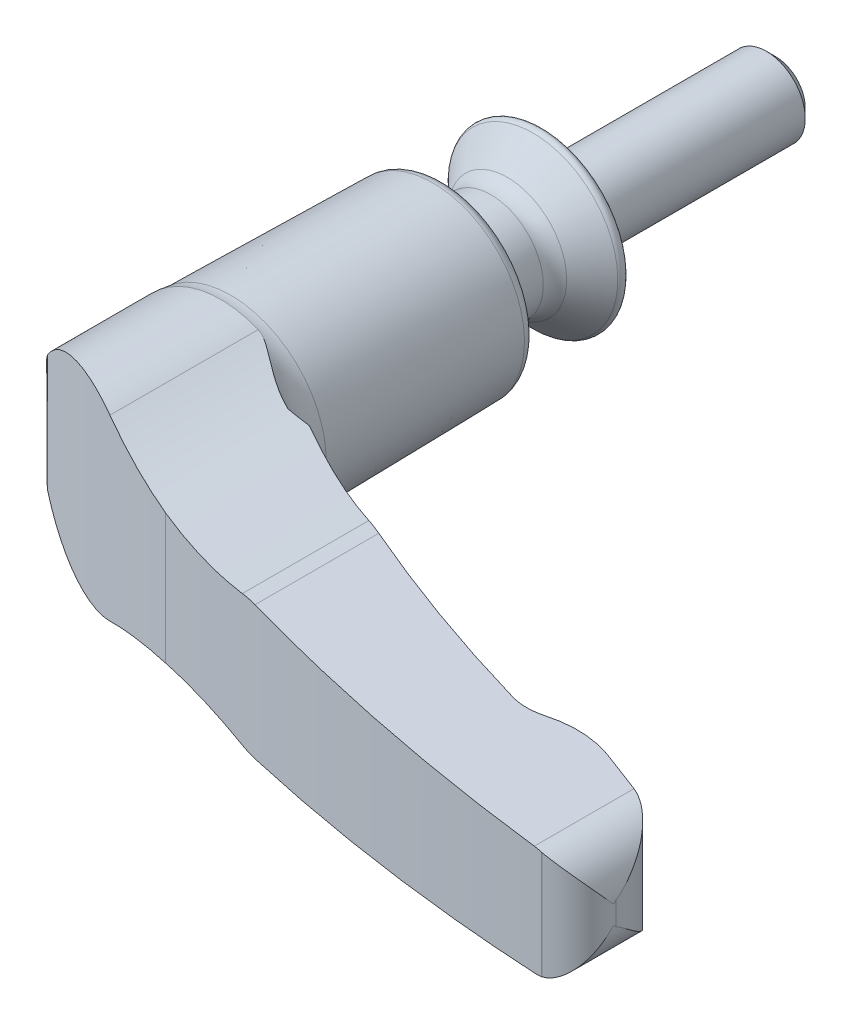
ISO-10303-21;
HEADER;
FILE_DESCRIPTION(('STEP AP214'),'2;1');
FILE_NAME('part.step','',(''),(''),'','','');
FILE_SCHEMA(('AUTOMOTIVE_DESIGN { 1 0 10303 214 1 1 1 1 }'));
ENDSEC;
DATA;
#1=APPLICATION_CONTEXT('core data for automotive mechanical design processes');
#2=APPLICATION_PROTOCOL_DEFINITION('international standard','automotive_design',2000,#1);
#3=PRODUCT_CONTEXT('',#1,'mechanical');
#4=PRODUCT('Part','Part','',(#3));
#5=PRODUCT_RELATED_PRODUCT_CATEGORY('part','',(#4));
#6=PRODUCT_DEFINITION_FORMATION('','',#4);
#7=PRODUCT_DEFINITION_CONTEXT('part definition',#1,'design');
#8=PRODUCT_DEFINITION('design','',#6,#7);
#9=PRODUCT_DEFINITION_SHAPE('','',#8);
#10=(LENGTH_UNIT() NAMED_UNIT(*) SI_UNIT(.MILLI.,.METRE.));
#11=(NAMED_UNIT(*) PLANE_ANGLE_UNIT() SI_UNIT($,.RADIAN.));
#12=(NAMED_UNIT(*) SI_UNIT($,.STERADIAN.) SOLID_ANGLE_UNIT());
#13=UNCERTAINTY_MEASURE_WITH_UNIT(LENGTH_MEASURE(1.E-05),#10,'distance_accuracy_value','');
#14=(GEOMETRIC_REPRESENTATION_CONTEXT(3) GLOBAL_UNCERTAINTY_ASSIGNED_CONTEXT((#13)) GLOBAL_UNIT_ASSIGNED_CONTEXT((#10,
#11,#12)) REPRESENTATION_CONTEXT('',''));
#15=CARTESIAN_POINT('',(0.,0.,0.));
#16=DIRECTION('',(0.,0.,1.));
#17=DIRECTION('',(1.,0.,0.));
#18=AXIS2_PLACEMENT_3D('',#15,#16,#17);
#19=CARTESIAN_POINT('',(-12.2494442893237,-13.45,40.2250875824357));
#20=DIRECTION('',(0.,0.,1.));
#21=DIRECTION('',(-1.,0.,0.));
#22=AXIS2_PLACEMENT_3D('',#19,#20,#21);
#23=PLANE('',#22);
#24=DIRECTION('',(0.,1.,0.));
#25=VECTOR('',#24,1.);
#26=CARTESIAN_POINT('',(-12.2494442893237,-13.45,40.2250875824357));
#27=LINE('',#26,#25);
#28=CARTESIAN_POINT('',(-12.2494442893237,-1.12726551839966,40.2250875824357));
#29=VERTEX_POINT('',#28);
#30=CARTESIAN_POINT('',(-12.2494442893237,0.,40.2250875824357));
#31=VERTEX_POINT('',#30);
#32=EDGE_CURVE('E175',#29,#31,#27,.T.);
#33=ORIENTED_EDGE('',*,*,#32,.T.);
#34=CARTESIAN_POINT('',(-1.62642046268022E-13,0.,40.2250875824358));
#35=DIRECTION('',(0.,0.,1.));
#36=DIRECTION('',(-1.,0.,0.));
#37=AXIS2_PLACEMENT_3D('',#34,#35,#36);
#38=CIRCLE('',#37,12.2494442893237);
#39=EDGE_CURVE('E178',#31,#31,#38,.F.);
#40=ORIENTED_EDGE('',*,*,#39,.F.);
#41=CARTESIAN_POINT('',(-12.2494442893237,1.12726551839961,40.2250875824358));
#42=VERTEX_POINT('',#41);
#43=EDGE_CURVE('E185',#31,#42,#27,.T.);
#44=ORIENTED_EDGE('',*,*,#43,.T.);
#45=CARTESIAN_POINT('',(0.,0.,40.2250875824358));
#46=DIRECTION('',(0.,0.,-1.));
#47=DIRECTION('',(1.,0.,0.));
#48=AXIS2_PLACEMENT_3D('',#45,#46,#47);
#49=CIRCLE('',#48,12.3012037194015);
#50=EDGE_CURVE('E180',#42,#29,#49,.T.);
#51=ORIENTED_EDGE('',*,*,#50,.T.);
#52=EDGE_LOOP('',(#33,#40,#44,#51));
#53=FACE_BOUND('',#52,.T.);
#54=ADVANCED_FACE('F14',(#53),#23,.F.);
#55=CARTESIAN_POINT('',(-12.3990914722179,-13.45,48.8947231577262));
#56=DIRECTION('',(0.999851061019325,0.,0.0172584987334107));
#57=DIRECTION('',(-0.0172584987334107,0.,0.999851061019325));
#58=AXIS2_PLACEMENT_3D('',#55,#56,#57);
#59=PLANE('',#58);
#60=ORIENTED_EDGE('',*,*,#43,.F.);
#61=ORIENTED_EDGE('',*,*,#32,.F.);
#62=CARTESIAN_POINT('',(-12.2494408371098,-1.12726105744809,40.2248875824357));
#63=CARTESIAN_POINT('',(-12.2501546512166,-1.12801102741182,40.2662415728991));
#64=CARTESIAN_POINT('',(-12.2508608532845,-1.13338949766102,40.3071545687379));
#65=CARTESIAN_POINT('',(-12.2522296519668,-1.15131266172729,40.3864543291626));
#66=CARTESIAN_POINT('',(-12.2528928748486,-1.16369170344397,40.4248773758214));
#67=CARTESIAN_POINT('',(-12.254538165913,-1.20206398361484,40.520195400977));
#68=CARTESIAN_POINT('',(-12.255493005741,-1.23180007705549,40.575512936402));
#69=CARTESIAN_POINT('',(-12.257344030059,-1.29909643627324,40.6827498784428));
#70=CARTESIAN_POINT('',(-12.2582382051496,-1.33683049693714,40.7345528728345));
#71=CARTESIAN_POINT('',(-12.2604895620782,-1.44052319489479,40.8649826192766));
#72=CARTESIAN_POINT('',(-12.2618006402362,-1.50977612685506,40.9409384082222));
#73=CARTESIAN_POINT('',(-12.264338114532,-1.65349391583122,41.0879440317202));
#74=CARTESIAN_POINT('',(-12.2655642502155,-1.72797350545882,41.1589787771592));
#75=CARTESIAN_POINT('',(-12.2678450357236,-1.87254522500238,41.2911134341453));
#76=CARTESIAN_POINT('',(-12.268904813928,-1.94236687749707,41.3525104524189));
#77=CARTESIAN_POINT('',(-12.2709847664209,-2.08326818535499,41.4730100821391));
#78=CARTESIAN_POINT('',(-12.2720051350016,-2.15433817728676,41.5321239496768));
#79=CARTESIAN_POINT('',(-12.2730148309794,-2.22587171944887,41.5906195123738));
#80=B_SPLINE_CURVE_WITH_KNOTS('',3,(#62,#63,#64,#65,#66,#67,#68,#69,#70,#71,#72,#73,#74,#75,#76,
#77,#78,#79),.UNSPECIFIED.,.F.,.F.,(4,2,2,2,2,2,2,2,4),(0.,0.123330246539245,0.243857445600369,
0.431247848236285,0.623227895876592,0.931023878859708,1.23972530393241,1.51862793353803,
1.79591047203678),.UNSPECIFIED.);
#81=CARTESIAN_POINT('',(-12.271249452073,-2.10212675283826,41.4883443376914));
#82=VERTEX_POINT('',#81);
#83=EDGE_CURVE('E399',#29,#82,#80,.T.);
#84=ORIENTED_EDGE('',*,*,#83,.T.);
#85=CARTESIAN_POINT('',(0.,0.,-669.432227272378));
#86=DIRECTION('',(0.999851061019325,0.,0.0172584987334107));
#87=DIRECTION('',(0.0172584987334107,0.,-0.999851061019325));
#88=AXIS2_PLACEMENT_3D('',#85,#86,#87);
#89=ELLIPSE('',#88,721.383718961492,12.45);
#90=CARTESIAN_POINT('',(-12.3990914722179,-1.12473581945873,48.8947231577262));
#91=VERTEX_POINT('',#90);
#92=EDGE_CURVE('E239',#82,#91,#89,.F.);
#93=ORIENTED_EDGE('',*,*,#92,.T.);
#94=DIRECTION('',(0.,1.,0.));
#95=VECTOR('',#94,1.);
#96=CARTESIAN_POINT('',(-12.3990914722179,-13.45,48.8947231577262));
#97=LINE('',#96,#95);
#98=CARTESIAN_POINT('',(-12.3990914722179,1.12473581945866,48.8947231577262));
#99=VERTEX_POINT('',#98);
#100=EDGE_CURVE('E184',#91,#99,#97,.T.);
#101=ORIENTED_EDGE('',*,*,#100,.T.);
#102=CARTESIAN_POINT('',(0.,0.,-669.432227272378));
#103=DIRECTION('',(0.999851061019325,0.,0.0172584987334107));
#104=DIRECTION('',(0.0172584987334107,0.,-0.999851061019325));
#105=AXIS2_PLACEMENT_3D('',#102,#103,#104);
#106=ELLIPSE('',#105,721.383718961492,12.45);
#107=CARTESIAN_POINT('',(-12.271249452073,2.10212675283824,41.4883443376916));
#108=VERTEX_POINT('',#107);
#109=EDGE_CURVE('E263',#99,#108,#106,.F.);
#110=ORIENTED_EDGE('',*,*,#109,.T.);
#111=CARTESIAN_POINT('',(-12.2730148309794,2.2258717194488,41.5906195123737));
#112=CARTESIAN_POINT('',(-12.2723484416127,2.17857656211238,41.5520130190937));
#113=CARTESIAN_POINT('',(-12.2716768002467,2.13153645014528,41.5131022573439));
#114=CARTESIAN_POINT('',(-12.2703199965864,2.03804940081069,41.4344974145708));
#115=CARTESIAN_POINT('',(-12.269634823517,1.99160298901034,41.3948027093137));
#116=CARTESIAN_POINT('',(-12.2675030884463,1.84986894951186,41.2713031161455));
#117=CARTESIAN_POINT('',(-12.2660309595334,1.75583214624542,41.1860170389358));
#118=CARTESIAN_POINT('',(-12.2637374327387,1.61936868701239,41.0531442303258));
#119=CARTESIAN_POINT('',(-12.2629577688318,1.574598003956,41.0079753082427));
#120=CARTESIAN_POINT('',(-12.2613598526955,1.48744881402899,40.9154018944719));
#121=CARTESIAN_POINT('',(-12.2605416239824,1.44506888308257,40.8679987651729));
#122=CARTESIAN_POINT('',(-12.2588634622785,1.36463549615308,40.7707764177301));
#123=CARTESIAN_POINT('',(-12.2580043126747,1.32652790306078,40.7210025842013));
#124=CARTESIAN_POINT('',(-12.2562147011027,1.25655247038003,40.6173235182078));
#125=CARTESIAN_POINT('',(-12.2552845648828,1.22465826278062,40.5634371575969));
#126=CARTESIAN_POINT('',(-12.2536883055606,1.18138793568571,40.4709597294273));
#127=CARTESIAN_POINT('',(-12.2530490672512,1.16676743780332,40.4339262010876));
#128=CARTESIAN_POINT('',(-12.2517389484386,1.14385333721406,40.3580259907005));
#129=CARTESIAN_POINT('',(-12.251068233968,1.13552979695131,40.3191689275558));
#130=CARTESIAN_POINT('',(-12.2500751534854,1.12891545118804,40.2616359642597));
#131=CARTESIAN_POINT('',(-12.2497582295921,1.12764004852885,40.2432753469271));
#132=CARTESIAN_POINT('',(-12.2494408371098,1.12726105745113,40.2248875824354));
#133=B_SPLINE_CURVE_WITH_KNOTS('',3,(#111,#112,#113,#114,#115,#116,#117,#118,#119,#120,#121,
#122,#123,#124,#125,#126,#127,#128,#129,#130,#131,#132),.UNSPECIFIED.,.F.,.F.,(4,2,2,2,2,2,2,2,
2,2,4),(0.,0.183152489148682,0.366457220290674,0.747103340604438,0.937859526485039,
1.12850085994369,1.31635856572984,1.50340080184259,1.62247471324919,1.74097889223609,
1.79613687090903),.UNSPECIFIED.);
#134=EDGE_CURVE('E190',#108,#42,#133,.T.);
#135=ORIENTED_EDGE('',*,*,#134,.T.);
#136=EDGE_LOOP('',(#60,#61,#84,#93,#101,#110,#135));
#137=FACE_BOUND('',#136,.T.);
#138=ADVANCED_FACE('F188',(#137),#59,.F.);
#139=CARTESIAN_POINT('',(111.767919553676,-13.45,-139.797819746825));
#140=DIRECTION('',(0.,1.,0.));
#141=DIRECTION('',(-1.,0.,0.));
#142=AXIS2_PLACEMENT_3D('',#139,#140,#141);
#143=CYLINDRICAL_SURFACE('',#142,208.999999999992);
#144=DIRECTION('',(0.,1.,0.));
#145=VECTOR('',#144,1.);
#146=CARTESIAN_POINT('',(15.7999999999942,-13.45,45.8662812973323));
#147=LINE('',#146,#145);
#148=CARTESIAN_POINT('',(15.8,-8.43613014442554,45.8662812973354));
#149=VERTEX_POINT('',#148);
#150=CARTESIAN_POINT('',(15.8,0.,45.8662812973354));
#151=VERTEX_POINT('',#150);
#152=EDGE_CURVE('E191',#149,#151,#147,.T.);
#153=ORIENTED_EDGE('',*,*,#152,.T.);
#154=DIRECTION('',(0.,1.,0.));
#155=VECTOR('',#154,1.);
#156=CARTESIAN_POINT('',(15.8,-13.45,45.8662812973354));
#157=LINE('',#156,#155);
#158=CARTESIAN_POINT('',(15.7999999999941,8.43613014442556,45.8662812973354));
#159=VERTEX_POINT('',#158);
#160=EDGE_CURVE('E413',#159,#151,#157,.F.);
#161=ORIENTED_EDGE('',*,*,#160,.F.);
#162=CARTESIAN_POINT('',(15.7999999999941,8.43613014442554,45.8662812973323));
#163=CARTESIAN_POINT('',(16.3870365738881,8.34717375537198,46.1697176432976));
#164=CARTESIAN_POINT('',(16.9767713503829,8.26904045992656,46.4710139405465));
#165=CARTESIAN_POINT('',(18.161091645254,8.13475115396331,47.0689822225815));
#166=CARTESIAN_POINT('',(18.7556773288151,8.07859589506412,47.3656540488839));
#167=CARTESIAN_POINT('',(20.5395968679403,7.94407204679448,48.2451118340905));
#168=CARTESIAN_POINT('',(21.7352391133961,7.89871013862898,48.8205177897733));
#169=CARTESIAN_POINT('',(24.1374209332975,7.89893976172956,49.9484747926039));
#170=CARTESIAN_POINT('',(25.3439611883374,7.94453701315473,50.5010244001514));
#171=CARTESIAN_POINT('',(27.1599173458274,8.0830634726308,51.3119106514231));
#172=CARTESIAN_POINT('',(27.7678474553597,8.14117035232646,51.5798888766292));
#173=CARTESIAN_POINT('',(28.9839481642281,8.28117670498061,52.1090693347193));
#174=CARTESIAN_POINT('',(29.5921187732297,8.36307725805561,52.370271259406));
#175=CARTESIAN_POINT('',(30.2000000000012,8.45699782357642,52.6279438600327));
#176=B_SPLINE_CURVE_WITH_KNOTS('',3,(#162,#163,#164,#165,#166,#167,#168,#169,#170,#171,#172,
#173,#174,#175),.UNSPECIFIED.,.F.,.F.,(4,2,2,2,2,2,4),(0.,2.00016069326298,4.00038978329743,
7.97994863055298,11.9597577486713,13.9600808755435,15.9604948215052),.UNSPECIFIED.);
#177=CARTESIAN_POINT('',(30.2000000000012,8.45699782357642,52.6279438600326));
#178=VERTEX_POINT('',#177);
#179=EDGE_CURVE('E264',#159,#178,#176,.T.);
#180=ORIENTED_EDGE('',*,*,#179,.T.);
#181=CARTESIAN_POINT('',(32.4002231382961,8.59297245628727,53.5458348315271));
#182=CARTESIAN_POINT('',(32.2157966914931,8.59945246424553,53.4701291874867));
#183=CARTESIAN_POINT('',(32.0313583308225,8.60144694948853,53.3941076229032));
#184=CARTESIAN_POINT('',(31.6631700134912,8.59650662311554,53.2417318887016));
#185=CARTESIAN_POINT('',(31.4794194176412,8.58958963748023,53.1653786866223));
#186=CARTESIAN_POINT('',(30.9288846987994,8.55552869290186,52.9356990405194));
#187=CARTESIAN_POINT('',(30.5630943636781,8.51506518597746,52.7818661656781));
#188=CARTESIAN_POINT('',(30.2000000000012,8.45699782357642,52.6279438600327));
#189=B_SPLINE_CURVE_WITH_KNOTS('',3,(#181,#182,#183,#184,#185,#186,#187,#188),.UNSPECIFIED.,.F.,
.F.,(4,2,2,4),(0.,0.598316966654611,1.19543895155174,2.3905773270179),.UNSPECIFIED.);
#190=CARTESIAN_POINT('',(32.4002231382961,8.59297245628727,53.5458348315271));
#191=VERTEX_POINT('',#190);
#192=EDGE_CURVE('E342',#191,#178,#189,.T.);
#193=ORIENTED_EDGE('',*,*,#192,.F.);
#194=CARTESIAN_POINT('',(111.767919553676,5.80486876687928,-139.797819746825));
#195=DIRECTION('',(-0.0351072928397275,-0.999383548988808,0.));
#196=DIRECTION('',(-0.999383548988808,0.0351072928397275,0.));
#197=AXIS2_PLACEMENT_3D('',#194,#195,#196);
#198=ELLIPSE('',#197,209.128917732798,208.999999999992);
#199=CARTESIAN_POINT('',(58.4999999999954,7.67611474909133,62.2999999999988));
#200=VERTEX_POINT('',#199);
#201=EDGE_CURVE('E350',#200,#191,#198,.T.);
#202=ORIENTED_EDGE('',*,*,#201,.F.);
#203=DIRECTION('',(0.,1.,0.));
#204=VECTOR('',#203,1.);
#205=CARTESIAN_POINT('',(58.4999999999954,-13.45,62.2999999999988));
#206=LINE('',#205,#204);
#207=CARTESIAN_POINT('',(58.4999999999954,-7.67611474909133,62.2999999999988));
#208=VERTEX_POINT('',#207);
#209=EDGE_CURVE('E193',#208,#200,#206,.T.);
#210=ORIENTED_EDGE('',*,*,#209,.F.);
#211=CARTESIAN_POINT('',(111.767919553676,-5.80486876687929,-139.797819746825));
#212=DIRECTION('',(-0.0351072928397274,0.999383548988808,0.));
#213=DIRECTION('',(0.999383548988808,0.0351072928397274,0.));
#214=AXIS2_PLACEMENT_3D('',#211,#212,#213);
#215=ELLIPSE('',#214,209.128917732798,208.999999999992);
#216=CARTESIAN_POINT('',(32.4002231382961,-8.59297245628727,53.5458348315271));
#217=VERTEX_POINT('',#216);
#218=EDGE_CURVE('E817',#217,#208,#215,.T.);
#219=ORIENTED_EDGE('',*,*,#218,.F.);
#220=CARTESIAN_POINT('',(30.2000000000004,-8.45699782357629,52.6279438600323));
#221=CARTESIAN_POINT('',(30.5630943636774,-8.51506518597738,52.7818661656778));
#222=CARTESIAN_POINT('',(30.9288846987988,-8.55552869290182,52.9356990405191));
#223=CARTESIAN_POINT('',(31.4794194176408,-8.58958963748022,53.1653786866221));
#224=CARTESIAN_POINT('',(31.6631700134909,-8.59650662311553,53.2417318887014));
#225=CARTESIAN_POINT('',(32.0313583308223,-8.60144694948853,53.3941076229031));
#226=CARTESIAN_POINT('',(32.215796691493,-8.59945246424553,53.4701291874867));
#227=CARTESIAN_POINT('',(32.4002231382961,-8.59297245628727,53.5458348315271));
#228=B_SPLINE_CURVE_WITH_KNOTS('',3,(#220,#221,#222,#223,#224,#225,#226,#227),.UNSPECIFIED.,.F.,
.F.,(4,2,2,4),(0.,1.19513837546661,1.79226036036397,2.39057732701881),.UNSPECIFIED.);
#229=CARTESIAN_POINT('',(30.2000000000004,-8.45699782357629,52.6279438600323));
#230=VERTEX_POINT('',#229);
#231=EDGE_CURVE('E317',#230,#217,#228,.T.);
#232=ORIENTED_EDGE('',*,*,#231,.F.);
#233=CARTESIAN_POINT('',(30.2,-8.45699782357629,52.6279438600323));
#234=CARTESIAN_POINT('',(29.5921187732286,-8.36307725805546,52.3702712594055));
#235=CARTESIAN_POINT('',(28.983948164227,-8.28117670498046,52.1090693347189));
#236=CARTESIAN_POINT('',(27.7678474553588,-8.14117035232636,51.5798888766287));
#237=CARTESIAN_POINT('',(27.1599173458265,-8.08306347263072,51.3119106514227));
#238=CARTESIAN_POINT('',(25.3439611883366,-7.94453701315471,50.5010244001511));
#239=CARTESIAN_POINT('',(24.1374209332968,-7.89893976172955,49.9484747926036));
#240=CARTESIAN_POINT('',(21.7352391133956,-7.89871013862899,48.820517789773));
#241=CARTESIAN_POINT('',(20.5395968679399,-7.9440720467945,48.2451118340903));
#242=CARTESIAN_POINT('',(18.7556773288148,-8.07859589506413,47.3656540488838));
#243=CARTESIAN_POINT('',(18.1610916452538,-8.13475115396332,47.0689822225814));
#244=CARTESIAN_POINT('',(16.9767713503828,-8.26904045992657,46.4710139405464));
#245=CARTESIAN_POINT('',(16.387036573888,-8.34717375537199,46.1697176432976));
#246=CARTESIAN_POINT('',(15.7999999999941,-8.43613014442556,45.8662812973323));
#247=B_SPLINE_CURVE_WITH_KNOTS('',3,(#233,#234,#235,#236,#237,#238,#239,#240,#241,#242,#243,
#244,#245,#246),.UNSPECIFIED.,.F.,.F.,(4,2,2,2,2,2,4),(0.,2.00041394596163,4.00073707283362,
7.98054619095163,11.9601050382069,13.9603341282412,15.960494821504),.UNSPECIFIED.);
#248=EDGE_CURVE('E335',#230,#149,#247,.T.);
#249=ORIENTED_EDGE('',*,*,#248,.T.);
#250=EDGE_LOOP('',(#153,#161,#180,#193,#202,#210,#219,#232,#249));
#251=FACE_BOUND('',#250,.T.);
#252=ADVANCED_FACE('F325',(#251),#143,.F.);
#253=CARTESIAN_POINT('',(76.9,-13.45,77.));
#254=DIRECTION('',(0.,0.,-1.));
#255=DIRECTION('',(0.,1.,0.));
#256=AXIS2_PLACEMENT_3D('',#253,#254,#255);
#257=PLANE('',#256);
#258=DIRECTION('',(0.,1.,0.));
#259=VECTOR('',#258,1.);
#260=CARTESIAN_POINT('',(76.9,-13.45,77.));
#261=LINE('',#260,#259);
#262=CARTESIAN_POINT('',(76.9,-6.92676825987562,77.));
#263=VERTEX_POINT('',#262);
#264=CARTESIAN_POINT('',(76.9,6.92676825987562,77.));
#265=VERTEX_POINT('',#264);
#266=EDGE_CURVE('E790',#263,#265,#261,.T.);
#267=ORIENTED_EDGE('',*,*,#266,.T.);
#268=CARTESIAN_POINT('',(75.6,1.17177043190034,77.));
#269=DIRECTION('',(0.,0.,-1.));
#270=DIRECTION('',(0.,1.,0.));
#271=AXIS2_PLACEMENT_3D('',#268,#269,#270);
#272=CIRCLE('',#271,5.9);
#273=CARTESIAN_POINT('',(76.8,6.94844767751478,77.));
#274=VERTEX_POINT('',#273);
#275=EDGE_CURVE('E860',#265,#274,#272,.F.);
#276=ORIENTED_EDGE('',*,*,#275,.T.);
#277=DIRECTION('',(0.,1.,0.));
#278=VECTOR('',#277,1.);
#279=CARTESIAN_POINT('',(76.8,-13.45,77.));
#280=LINE('',#279,#278);
#281=CARTESIAN_POINT('',(76.8,-6.94844767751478,77.));
#282=VERTEX_POINT('',#281);
#283=EDGE_CURVE('E788',#282,#274,#280,.T.);
#284=ORIENTED_EDGE('',*,*,#283,.F.);
#285=CARTESIAN_POINT('',(75.6,-1.17177043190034,77.));
#286=DIRECTION('',(0.,0.,-1.));
#287=DIRECTION('',(0.,1.,0.));
#288=AXIS2_PLACEMENT_3D('',#285,#286,#287);
#289=CIRCLE('',#288,5.9);
#290=EDGE_CURVE('E903',#282,#263,#289,.F.);
#291=ORIENTED_EDGE('',*,*,#290,.T.);
#292=EDGE_LOOP('',(#267,#276,#284,#291));
#293=FACE_BOUND('',#292,.T.);
#294=ADVANCED_FACE('F329',(#293),#257,.F.);
#295=CARTESIAN_POINT('',(99.3774025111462,-13.45,-191.753327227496));
#296=DIRECTION('',(0.,1.,0.));
#297=DIRECTION('',(-1.,0.,0.));
#298=AXIS2_PLACEMENT_3D('',#295,#296,#297);
#299=CYLINDRICAL_SURFACE('',#298,269.7);
#300=CARTESIAN_POINT('',(16.1999999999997,8.37725139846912,64.8));
#301=CARTESIAN_POINT('',(16.7767031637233,8.29486390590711,64.9869756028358));
#302=CARTESIAN_POINT('',(17.3553557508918,8.22300064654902,65.1724296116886));
#303=CARTESIAN_POINT('',(18.5159500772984,8.10050516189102,65.5400576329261));
#304=CARTESIAN_POINT('',(19.0978918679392,8.04987326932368,65.7222315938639));
#305=CARTESIAN_POINT('',(20.8414876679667,7.93052773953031,66.2615450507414));
#306=CARTESIAN_POINT('',(22.0070770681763,7.89348273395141,66.6134754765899));
#307=CARTESIAN_POINT('',(24.3425845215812,7.90540743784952,67.3013928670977));
#308=CARTESIAN_POINT('',(25.512502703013,7.95437971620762,67.6373793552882));
#309=CARTESIAN_POINT('',(27.2687809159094,8.09314767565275,68.1289718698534));
#310=CARTESIAN_POINT('',(27.8560018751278,8.15052863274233,68.2911856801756));
#311=CARTESIAN_POINT('',(29.0291528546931,8.28726693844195,68.611001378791));
#312=CARTESIAN_POINT('',(29.6150828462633,8.36662477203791,68.7686031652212));
#313=CARTESIAN_POINT('',(30.2000000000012,8.45699782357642,68.9238236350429));
#314=B_SPLINE_CURVE_WITH_KNOTS('',3,(#300,#301,#302,#303,#304,#305,#306,#307,#308,#309,#310,
#311,#312,#313),.UNSPECIFIED.,.F.,.F.,(4,2,2,2,2,2,4),(0.,1.83529834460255,3.6706254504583,
7.32170279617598,10.9728891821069,12.808257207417,14.6436657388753),.UNSPECIFIED.);
#315=CARTESIAN_POINT('',(16.1999999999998,8.37725139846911,64.8));
#316=VERTEX_POINT('',#315);
#317=CARTESIAN_POINT('',(30.2000000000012,8.45699782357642,68.9238236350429));
#318=VERTEX_POINT('',#317);
#319=EDGE_CURVE('E775',#316,#318,#314,.T.);
#320=ORIENTED_EDGE('',*,*,#319,.F.);
#321=DIRECTION('',(0.,1.,0.));
#322=VECTOR('',#321,1.);
#323=CARTESIAN_POINT('',(16.1999999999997,-13.45,64.8));
#324=LINE('',#323,#322);
#325=CARTESIAN_POINT('',(16.1999999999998,-8.37725139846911,64.8));
#326=VERTEX_POINT('',#325);
#327=EDGE_CURVE('E349',#326,#316,#324,.T.);
#328=ORIENTED_EDGE('',*,*,#327,.F.);
#329=CARTESIAN_POINT('',(30.2,-8.45699782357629,68.9238236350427));
#330=CARTESIAN_POINT('',(29.6150828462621,-8.36662477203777,68.7686031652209));
#331=CARTESIAN_POINT('',(29.029152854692,-8.28726693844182,68.6110013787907));
#332=CARTESIAN_POINT('',(27.8560018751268,-8.15052863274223,68.2911856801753));
#333=CARTESIAN_POINT('',(27.2687809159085,-8.09314767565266,68.1289718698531));
#334=CARTESIAN_POINT('',(25.5125027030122,-7.95437971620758,67.637379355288));
#335=CARTESIAN_POINT('',(24.3425845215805,-7.9054074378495,67.3013928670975));
#336=CARTESIAN_POINT('',(22.0070770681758,-7.89348273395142,66.6134754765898));
#337=CARTESIAN_POINT('',(20.8414876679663,-7.93052773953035,66.2615450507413));
#338=CARTESIAN_POINT('',(19.097891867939,-8.0498732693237,65.7222315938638));
#339=CARTESIAN_POINT('',(18.5159500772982,-8.10050516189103,65.540057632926));
#340=CARTESIAN_POINT('',(17.3553557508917,-8.22300064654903,65.1724296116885));
#341=CARTESIAN_POINT('',(16.7767031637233,-8.29486390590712,64.9869756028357));
#342=CARTESIAN_POINT('',(16.1999999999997,-8.37725139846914,64.8));
#343=B_SPLINE_CURVE_WITH_KNOTS('',3,(#329,#330,#331,#332,#333,#334,#335,#336,#337,#338,#339,
#340,#341,#342),.UNSPECIFIED.,.F.,.F.,(4,2,2,2,2,2,4),(0.,1.83540853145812,3.67077655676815,
7.32196294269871,10.9730402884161,12.8083673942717,14.6436657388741),.UNSPECIFIED.);
#344=CARTESIAN_POINT('',(30.2000000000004,-8.45699782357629,68.9238236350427));
#345=VERTEX_POINT('',#344);
#346=EDGE_CURVE('E446',#345,#326,#343,.T.);
#347=ORIENTED_EDGE('',*,*,#346,.F.);
#348=CARTESIAN_POINT('',(30.2000000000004,-8.45699782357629,68.9238236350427));
#349=CARTESIAN_POINT('',(30.5632894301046,-8.51510955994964,69.0202386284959));
#350=CARTESIAN_POINT('',(30.9292671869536,-8.55556829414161,69.1165394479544));
#351=CARTESIAN_POINT('',(31.4798508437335,-8.58960835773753,69.2601745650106));
#352=CARTESIAN_POINT('',(31.6635722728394,-8.5965163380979,69.3078974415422));
#353=CARTESIAN_POINT('',(32.0316308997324,-8.60144626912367,69.4030885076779));
#354=CARTESIAN_POINT('',(32.21596856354,-8.59944866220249,69.4505559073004));
#355=CARTESIAN_POINT('',(32.4002231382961,-8.59297245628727,69.4977922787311));
#356=B_SPLINE_CURVE_WITH_KNOTS('',3,(#348,#349,#350,#351,#352,#353,#354,#355),.UNSPECIFIED.,.F.,
.F.,(4,2,2,4),(0.,1.14021168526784,1.70984874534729,2.2807374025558),.UNSPECIFIED.);
#357=CARTESIAN_POINT('',(32.4002231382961,-8.59297245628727,69.497792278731));
#358=VERTEX_POINT('',#357);
#359=EDGE_CURVE('E292',#345,#358,#356,.T.);
#360=ORIENTED_EDGE('',*,*,#359,.T.);
#361=CARTESIAN_POINT('',(99.3774025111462,-6.24013459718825,-191.753327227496));
#362=DIRECTION('',(-0.0351072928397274,0.999383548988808,0.));
#363=DIRECTION('',(0.999383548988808,0.0351072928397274,0.));
#364=AXIS2_PLACEMENT_3D('',#361,#362,#363);
#365=ELLIPSE('',#364,269.866359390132,269.7);
#366=CARTESIAN_POINT('',(75.8071330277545,-7.06813337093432,76.9147438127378));
#367=VERTEX_POINT('',#366);
#368=EDGE_CURVE('E304',#358,#367,#365,.T.);
#369=ORIENTED_EDGE('',*,*,#368,.T.);
#370=CARTESIAN_POINT('',(75.8071330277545,-7.06813337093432,76.9147438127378));
#371=CARTESIAN_POINT('',(75.9742663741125,-7.06223993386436,76.929403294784));
#372=CARTESIAN_POINT('',(76.1405719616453,-7.04931940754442,76.943837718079));
#373=CARTESIAN_POINT('',(76.4715276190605,-7.00942417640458,76.9722564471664));
#374=CARTESIAN_POINT('',(76.6361776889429,-6.98244947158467,76.9862407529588));
#375=CARTESIAN_POINT('',(76.8,-6.94844767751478,77.));
#376=B_SPLINE_CURVE_WITH_KNOTS('',3,(#370,#371,#372,#373,#374,#375),.UNSPECIFIED.,.F.,.F.,(4,2,
4),(0.,0.50229032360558,1.00458064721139),.UNSPECIFIED.);
#377=EDGE_CURVE('E905',#367,#282,#376,.T.);
#378=ORIENTED_EDGE('',*,*,#377,.T.);
#379=ORIENTED_EDGE('',*,*,#283,.T.);
#380=CARTESIAN_POINT('',(76.8,6.94844767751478,77.));
#381=CARTESIAN_POINT('',(76.6361776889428,6.98244947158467,76.9862407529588));
#382=CARTESIAN_POINT('',(76.4715276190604,7.00942417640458,76.9722564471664));
#383=CARTESIAN_POINT('',(76.1405719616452,7.04931940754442,76.943837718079));
#384=CARTESIAN_POINT('',(75.9742663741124,7.06223993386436,76.929403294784));
#385=CARTESIAN_POINT('',(75.8071330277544,7.06813337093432,76.9147438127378));
#386=B_SPLINE_CURVE_WITH_KNOTS('',3,(#380,#381,#382,#383,#384,#385),.UNSPECIFIED.,.F.,.F.,(4,2,
4),(0.,0.502290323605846,1.00458064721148),.UNSPECIFIED.);
#387=CARTESIAN_POINT('',(75.8071330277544,7.06813337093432,76.9147438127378));
#388=VERTEX_POINT('',#387);
#389=EDGE_CURVE('E847',#274,#388,#386,.T.);
#390=ORIENTED_EDGE('',*,*,#389,.T.);
#391=CARTESIAN_POINT('',(99.3774025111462,6.24013459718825,-191.753327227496));
#392=DIRECTION('',(-0.0351072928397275,-0.999383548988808,0.));
#393=DIRECTION('',(-0.999383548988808,0.0351072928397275,0.));
#394=AXIS2_PLACEMENT_3D('',#391,#392,#393);
#395=ELLIPSE('',#394,269.866359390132,269.7);
#396=CARTESIAN_POINT('',(32.4002231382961,8.59297245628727,69.497792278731));
#397=VERTEX_POINT('',#396);
#398=EDGE_CURVE('E372',#388,#397,#395,.T.);
#399=ORIENTED_EDGE('',*,*,#398,.T.);
#400=CARTESIAN_POINT('',(32.4002231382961,8.59297245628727,69.497792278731));
#401=CARTESIAN_POINT('',(32.2159685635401,8.59944866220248,69.4505559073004));
#402=CARTESIAN_POINT('',(32.0316308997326,8.60144626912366,69.4030885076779));
#403=CARTESIAN_POINT('',(31.6635722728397,8.5965163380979,69.3078974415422));
#404=CARTESIAN_POINT('',(31.4798508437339,8.58960835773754,69.2601745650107));
#405=CARTESIAN_POINT('',(30.9292671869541,8.55556829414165,69.1165394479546));
#406=CARTESIAN_POINT('',(30.5632894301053,8.51510955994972,69.0202386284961));
#407=CARTESIAN_POINT('',(30.2000000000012,8.45699782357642,68.9238236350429));
#408=B_SPLINE_CURVE_WITH_KNOTS('',3,(#400,#401,#402,#403,#404,#405,#406,#407),.UNSPECIFIED.,.F.,
.F.,(4,2,2,4),(0.,0.5708886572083,1.14052571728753,2.28073740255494),.UNSPECIFIED.);
#409=EDGE_CURVE('E363',#397,#318,#408,.T.);
#410=ORIENTED_EDGE('',*,*,#409,.T.);
#411=EDGE_LOOP('',(#320,#328,#347,#360,#369,#378,#379,#390,#399,#410));
#412=FACE_BOUND('',#411,.T.);
#413=ADVANCED_FACE('F306',(#412),#299,.T.);
#414=CARTESIAN_POINT('',(79.8840849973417,-13.45,-124.78991881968));
#415=DIRECTION('',(0.,1.,0.));
#416=DIRECTION('',(-1.,0.,0.));
#417=AXIS2_PLACEMENT_3D('',#414,#415,#416);
#418=CYLINDRICAL_SURFACE('',#417,200.000000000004);
#419=DIRECTION('',(0.,1.,0.));
#420=VECTOR('',#419,1.);
#421=CARTESIAN_POINT('',(-9.90000000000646,-13.45,53.9244289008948));
#422=LINE('',#421,#420);
#423=CARTESIAN_POINT('',(-9.90000000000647,-7.54933771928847,53.9244289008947));
#424=VERTEX_POINT('',#423);
#425=CARTESIAN_POINT('',(-9.90000000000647,7.54933771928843,53.9244289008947));
#426=VERTEX_POINT('',#425);
#427=EDGE_CURVE('E199',#424,#426,#422,.T.);
#428=ORIENTED_EDGE('',*,*,#427,.F.);
#429=CARTESIAN_POINT('',(-9.90000000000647,-7.54933771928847,53.9244289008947));
#430=CARTESIAN_POINT('',(-9.67451817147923,-7.84507120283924,54.0377127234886));
#431=CARTESIAN_POINT('',(-9.4368447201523,-8.12923310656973,54.1565790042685));
#432=CARTESIAN_POINT('',(-8.93966759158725,-8.67296304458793,54.403880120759));
#433=CARTESIAN_POINT('',(-8.68017587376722,-8.93254438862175,54.5323097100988));
#434=CARTESIAN_POINT('',(-8.14219185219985,-9.42550410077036,54.7970082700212));
#435=CARTESIAN_POINT('',(-7.86373776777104,-9.65893280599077,54.9332613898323));
#436=CARTESIAN_POINT('',(-7.28965149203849,-10.0992248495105,55.2124187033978));
#437=CARTESIAN_POINT('',(-6.994017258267,-10.3060850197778,55.3553236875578));
#438=CARTESIAN_POINT('',(-6.38843577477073,-10.6920089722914,55.6461218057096));
#439=CARTESIAN_POINT('',(-6.07851806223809,-10.8711270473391,55.7940044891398));
#440=CARTESIAN_POINT('',(-5.44596700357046,-11.2013953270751,56.0937585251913));
#441=CARTESIAN_POINT('',(-5.12333306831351,-11.3525442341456,56.2456300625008));
#442=CARTESIAN_POINT('',(-4.46756903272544,-11.6262415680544,56.5521043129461));
#443=CARTESIAN_POINT('',(-4.13444284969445,-11.7488005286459,56.7067059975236));
#444=CARTESIAN_POINT('',(-3.45976822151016,-11.9648655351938,57.0175072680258));
#445=CARTESIAN_POINT('',(-3.11822142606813,-12.0583772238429,57.1737065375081));
#446=CARTESIAN_POINT('',(-2.31903314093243,-12.2409805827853,57.5364253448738));
#447=CARTESIAN_POINT('',(-1.85895294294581,-12.3192478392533,57.743179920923));
#448=CARTESIAN_POINT('',(-1.16440659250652,-12.3976193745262,58.0521070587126));
#449=CARTESIAN_POINT('',(-0.932215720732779,-12.4172382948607,58.1548548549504));
#450=CARTESIAN_POINT('',(-0.466758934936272,-12.443430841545,58.3597645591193));
#451=CARTESIAN_POINT('',(-0.233492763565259,-12.4500011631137,58.4619263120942));
#452=CARTESIAN_POINT('',(0.405450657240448,-12.4499979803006,58.7403022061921));
#453=CARTESIAN_POINT('',(0.811584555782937,-12.4301810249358,58.9156432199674));
#454=CARTESIAN_POINT('',(1.62179032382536,-12.3506318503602,59.2622685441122));
#455=CARTESIAN_POINT('',(2.02586144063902,-12.2908859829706,59.4335514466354));
#456=CARTESIAN_POINT('',(2.83079805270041,-12.1308842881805,59.7716755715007));
#457=CARTESIAN_POINT('',(3.23162970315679,-12.030387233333,59.9384839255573));
#458=CARTESIAN_POINT('',(4.02384464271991,-11.7891025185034,60.2652335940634));
#459=CARTESIAN_POINT('',(4.41522782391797,-11.6483143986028,60.4251748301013));
#460=CARTESIAN_POINT('',(4.79999999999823,-11.4874931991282,60.5810071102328));
#461=B_SPLINE_CURVE_WITH_KNOTS('',3,(#429,#430,#431,#432,#433,#434,#435,#436,#437,#438,#439,
#440,#441,#442,#443,#444,#445,#446,#447,#448,#449,#450,#451,#452,#453,#454,#455,#456,#457,#458,
#459,#460),.UNSPECIFIED.,.F.,.F.,(4,2,2,2,2,2,2,2,2,2,2,2,2,2,2,4),(0.,1.16572536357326,
2.33081586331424,3.49362387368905,4.65657040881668,5.81721142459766,6.97790627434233,
8.1381727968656,9.29821378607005,10.8264676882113,11.5901890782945,12.3541038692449,
13.6806107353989,15.007571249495,16.3425041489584,17.67745228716),.UNSPECIFIED.);
#462=CARTESIAN_POINT('',(4.79999999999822,-11.4874931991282,60.5810071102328));
#463=VERTEX_POINT('',#462);
#464=EDGE_CURVE('E202',#424,#463,#461,.T.);
#465=ORIENTED_EDGE('',*,*,#464,.T.);
#466=CARTESIAN_POINT('',(16.1999999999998,-8.37725139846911,64.8));
#467=CARTESIAN_POINT('',(15.21368787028,-8.51813618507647,64.4687294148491));
#468=CARTESIAN_POINT('',(14.2339762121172,-8.68971619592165,64.1310391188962));
#469=CARTESIAN_POINT('',(12.2943158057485,-9.09213654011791,63.4457683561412));
#470=CARTESIAN_POINT('',(11.3343097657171,-9.32276678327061,63.0982267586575));
#471=CARTESIAN_POINT('',(9.43367460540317,-9.8421618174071,62.3938598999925));
#472=CARTESIAN_POINT('',(8.49304509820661,-10.1309254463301,62.0370348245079));
#473=CARTESIAN_POINT('',(6.63069309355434,-10.7662294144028,61.3147410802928));
#474=CARTESIAN_POINT('',(5.70904885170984,-11.1129696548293,60.9492463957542));
#475=CARTESIAN_POINT('',(4.79999999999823,-11.4874931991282,60.5810071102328));
#476=B_SPLINE_CURVE_WITH_KNOTS('',3,(#466,#467,#468,#469,#470,#471,#472,#473,#474,#475),
.UNSPECIFIED.,.F.,.F.,(4,2,2,2,4),(0.,3.14928931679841,6.2875260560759,9.42570006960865,
12.5749263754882),.UNSPECIFIED.);
#477=EDGE_CURVE('E211',#326,#463,#476,.T.);
#478=ORIENTED_EDGE('',*,*,#477,.F.);
#479=ORIENTED_EDGE('',*,*,#327,.T.);
#480=CARTESIAN_POINT('',(4.7999999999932,11.4874931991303,60.5810071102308));
#481=CARTESIAN_POINT('',(5.70904885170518,11.1129696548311,60.9492463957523));
#482=CARTESIAN_POINT('',(6.63069309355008,10.7662294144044,61.3147410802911));
#483=CARTESIAN_POINT('',(8.49304509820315,10.1309254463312,62.0370348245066));
#484=CARTESIAN_POINT('',(9.43367460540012,9.84216181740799,62.3938598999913));
#485=CARTESIAN_POINT('',(11.3343097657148,9.32276678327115,63.0982267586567));
#486=CARTESIAN_POINT('',(12.2943158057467,9.0921365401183,63.4457683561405));
#487=CARTESIAN_POINT('',(14.2339762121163,8.6897161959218,64.1310391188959));
#488=CARTESIAN_POINT('',(15.2136878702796,8.51813618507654,64.4687294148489));
#489=CARTESIAN_POINT('',(16.1999999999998,8.37725139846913,64.8));
#490=B_SPLINE_CURVE_WITH_KNOTS('',3,(#480,#481,#482,#483,#484,#485,#486,#487,#488,#489),
.UNSPECIFIED.,.F.,.F.,(4,2,2,2,4),(0.,3.14922630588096,6.28740031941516,9.42563705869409,
12.574926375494),.UNSPECIFIED.);
#491=CARTESIAN_POINT('',(4.7999999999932,11.4874931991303,60.5810071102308));
#492=VERTEX_POINT('',#491);
#493=EDGE_CURVE('E293',#492,#316,#490,.T.);
#494=ORIENTED_EDGE('',*,*,#493,.F.);
#495=CARTESIAN_POINT('',(4.79999999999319,11.4874931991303,60.5810071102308));
#496=CARTESIAN_POINT('',(4.41580947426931,11.6480694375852,60.425410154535));
#497=CARTESIAN_POINT('',(4.02503382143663,11.7886738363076,60.2657194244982));
#498=CARTESIAN_POINT('',(3.23419246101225,12.0296727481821,59.9395455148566));
#499=CARTESIAN_POINT('',(2.8341300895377,12.1300814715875,59.7730647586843));
#500=CARTESIAN_POINT('',(2.02936760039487,12.2903278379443,59.4350346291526));
#501=CARTESIAN_POINT('',(1.62468227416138,12.3502704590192,59.2634995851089));
#502=CARTESIAN_POINT('',(0.8131282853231,12.4301064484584,58.9163098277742));
#503=CARTESIAN_POINT('',(0.406259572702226,12.4499988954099,58.7406550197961));
#504=CARTESIAN_POINT('',(-0.381370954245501,12.4500010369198,58.3974981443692));
#505=CARTESIAN_POINT('',(-0.762205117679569,12.432473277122,58.230155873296));
#506=CARTESIAN_POINT('',(-1.52013839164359,12.3627058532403,57.8943010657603));
#507=CARTESIAN_POINT('',(-1.89723770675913,12.310468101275,57.7257885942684));
#508=CARTESIAN_POINT('',(-2.64540716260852,12.1716555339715,57.3887062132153));
#509=CARTESIAN_POINT('',(-3.0164722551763,12.0850533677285,57.2201363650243));
#510=CARTESIAN_POINT('',(-3.74968971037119,11.8780234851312,56.884389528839));
#511=CARTESIAN_POINT('',(-4.11184217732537,11.7575961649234,56.717212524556));
#512=CARTESIAN_POINT('',(-4.82530709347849,11.4832593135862,56.3853387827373));
#513=CARTESIAN_POINT('',(-5.17659902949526,11.329290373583,56.2206470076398));
#514=CARTESIAN_POINT('',(-5.86509267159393,10.9886630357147,55.8955080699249));
#515=CARTESIAN_POINT('',(-6.20229273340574,10.8020008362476,55.7350614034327));
#516=CARTESIAN_POINT('',(-6.85929279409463,10.3971732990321,55.4202886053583));
#517=CARTESIAN_POINT('',(-7.17912282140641,10.1790648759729,55.2659520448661));
#518=CARTESIAN_POINT('',(-7.79913838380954,9.71218172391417,54.9648338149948));
#519=CARTESIAN_POINT('',(-8.09933309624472,9.46342148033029,54.8180486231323));
#520=CARTESIAN_POINT('',(-8.6621015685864,8.9502892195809,54.5412436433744));
#521=CARTESIAN_POINT('',(-8.92582503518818,8.6874365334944,54.410747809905));
#522=CARTESIAN_POINT('',(-9.43052390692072,8.13678568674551,54.1597401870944));
#523=CARTESIAN_POINT('',(-9.67151657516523,7.8490067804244,54.03922082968));
#524=CARTESIAN_POINT('',(-9.90000000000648,7.54933771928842,53.9244289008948));
#525=B_SPLINE_CURVE_WITH_KNOTS('',3,(#495,#496,#497,#498,#499,#500,#501,#502,#503,#504,#505,
#506,#507,#508,#509,#510,#511,#512,#513,#514,#515,#516,#517,#518,#519,#520,#521,#522,#523,#524),
.UNSPECIFIED.,.F.,.F.,(4,2,2,2,2,2,2,2,2,2,2,2,2,2,4),(0.,1.33291829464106,2.66536494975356,
3.99434151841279,5.32334866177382,6.5709370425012,7.81845670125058,9.06697126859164,
10.3154712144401,11.5662007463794,12.8170758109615,14.0657146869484,15.3137657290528,
16.4958742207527,17.6770775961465),.UNSPECIFIED.);
#526=EDGE_CURVE('E286',#492,#426,#525,.T.);
#527=ORIENTED_EDGE('',*,*,#526,.T.);
#528=EDGE_LOOP('',(#428,#465,#478,#479,#494,#527));
#529=FACE_BOUND('',#528,.T.);
#530=ADVANCED_FACE('F248',(#529),#418,.T.);
#531=CARTESIAN_POINT('',(-6.3,-13.45,49.0000000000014));
#532=DIRECTION('',(0.,1.,0.));
#533=DIRECTION('',(-1.,0.,0.));
#534=AXIS2_PLACEMENT_3D('',#531,#532,#533);
#535=CYLINDRICAL_SURFACE('',#534,6.1);
#536=ORIENTED_EDGE('',*,*,#427,.T.);
#537=CARTESIAN_POINT('',(-9.90000000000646,7.54933771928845,53.9244289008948));
#538=CARTESIAN_POINT('',(-10.0046272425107,7.41212768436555,53.8479316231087));
#539=CARTESIAN_POINT('',(-10.1057058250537,7.27366477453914,53.7689319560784));
#540=CARTESIAN_POINT('',(-10.3008751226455,6.99453251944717,53.6064237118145));
#541=CARTESIAN_POINT('',(-10.3949674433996,6.8538636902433,53.5229161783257));
#542=CARTESIAN_POINT('',(-10.6668294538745,6.42916605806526,53.2664803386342));
#543=CARTESIAN_POINT('',(-10.8343792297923,6.14218866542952,53.0874940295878));
#544=CARTESIAN_POINT('',(-11.1421944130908,5.56422896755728,52.7176240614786));
#545=CARTESIAN_POINT('',(-11.2826072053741,5.27327804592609,52.5268125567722));
#546=CARTESIAN_POINT('',(-11.5382549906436,4.68755769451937,52.1345668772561));
#547=CARTESIAN_POINT('',(-11.6534929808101,4.39278872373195,51.9331339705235));
#548=CARTESIAN_POINT('',(-11.822924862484,3.90661945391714,51.5940966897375));
#549=CARTESIAN_POINT('',(-11.8842552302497,3.71572911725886,51.4592618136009));
#550=CARTESIAN_POINT('',(-11.9969703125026,3.33388552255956,51.1855148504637));
#551=CARTESIAN_POINT('',(-12.0483542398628,3.14293226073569,51.0466024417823));
#552=CARTESIAN_POINT('',(-12.1260618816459,2.82462255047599,50.8102464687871));
#553=CARTESIAN_POINT('',(-12.1550800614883,2.6969298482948,50.7141297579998));
#554=CARTESIAN_POINT('',(-12.2086854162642,2.44281059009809,50.5191072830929));
#555=CARTESIAN_POINT('',(-12.2332743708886,2.31638354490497,50.420202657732));
#556=CARTESIAN_POINT('',(-12.2704776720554,2.10831497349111,50.2522334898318));
#557=CARTESIAN_POINT('',(-12.2843345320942,2.02594231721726,50.1843484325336));
#558=CARTESIAN_POINT('',(-12.3100752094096,1.86314619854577,50.0459284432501));
#559=CARTESIAN_POINT('',(-12.3219596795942,1.78272209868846,49.9753943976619));
#560=CARTESIAN_POINT('',(-12.3424058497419,1.63475623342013,49.8387611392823));
#561=CARTESIAN_POINT('',(-12.3511943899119,1.56681696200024,49.7731262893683));
#562=CARTESIAN_POINT('',(-12.3670759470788,1.43603364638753,49.6366694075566));
#563=CARTESIAN_POINT('',(-12.3741715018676,1.37318207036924,49.5658553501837));
#564=CARTESIAN_POINT('',(-12.3830656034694,1.28954286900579,49.4555496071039));
#565=CARTESIAN_POINT('',(-12.3856658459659,1.26425474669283,49.4195939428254));
#566=CARTESIAN_POINT('',(-12.3903418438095,1.21756776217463,49.3451522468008));
#567=CARTESIAN_POINT('',(-12.3924179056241,1.19616662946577,49.3066677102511));
#568=CARTESIAN_POINT('',(-12.3955976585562,1.16270888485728,49.2340076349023));
#569=CARTESIAN_POINT('',(-12.3968091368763,1.14966347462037,49.2003044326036));
#570=CARTESIAN_POINT('',(-12.3986849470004,1.12925581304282,49.1312436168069));
#571=CARTESIAN_POINT('',(-12.3993512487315,1.12187310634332,49.0958924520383));
#572=CARTESIAN_POINT('',(-12.3999734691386,1.11497561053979,49.0327446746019));
#573=CARTESIAN_POINT('',(-12.4000585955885,1.11402993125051,49.0051039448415));
#574=CARTESIAN_POINT('',(-12.3998578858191,1.11624858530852,48.9497493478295));
#575=CARTESIAN_POINT('',(-12.399568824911,1.11944864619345,48.9220369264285));
#576=CARTESIAN_POINT('',(-12.3990914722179,1.12473581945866,48.8947231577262));
#577=B_SPLINE_CURVE_WITH_KNOTS('',3,(#537,#538,#539,#540,#541,#542,#543,#544,#545,#546,#547,
#548,#549,#550,#551,#552,#553,#554,#555,#556,#557,#558,#559,#560,#561,#562,#563,#564,#565,#566,
#567,#568,#569,#570,#571,#572,#573,#574,#575,#576),.UNSPECIFIED.,.F.,.F.,(4,2,2,2,2,2,2,2,2,2,2,
2,2,2,2,2,2,2,2,4),(0.,0.566113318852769,1.13209611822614,2.26300366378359,3.38758494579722,
4.5120322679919,5.23669041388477,5.96140588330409,6.44865012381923,6.93569814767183,
7.25857007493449,7.58133490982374,7.86586699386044,8.14996984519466,8.28191970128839,
8.41379223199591,8.52191310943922,8.6296415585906,8.71230660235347,8.79568880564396),.UNSPECIFIED.);
#578=EDGE_CURVE('E254',#426,#99,#577,.T.);
#579=ORIENTED_EDGE('',*,*,#578,.T.);
#580=ORIENTED_EDGE('',*,*,#100,.F.);
#581=CARTESIAN_POINT('',(-12.3990914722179,-1.12473581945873,48.8947231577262));
#582=CARTESIAN_POINT('',(-12.3996477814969,-1.11855680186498,48.9263072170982));
#583=CARTESIAN_POINT('',(-12.3999461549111,-1.11526130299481,48.9584257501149));
#584=CARTESIAN_POINT('',(-12.4000388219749,-1.1142553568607,49.0224040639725));
#585=CARTESIAN_POINT('',(-12.3998385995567,-1.11648414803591,49.0542628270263));
#586=CARTESIAN_POINT('',(-12.398957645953,-1.12621618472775,49.1171143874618));
#587=CARTESIAN_POINT('',(-12.3982771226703,-1.13371714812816,49.1481075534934));
#588=CARTESIAN_POINT('',(-12.3965024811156,-1.152962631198,49.2087543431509));
#589=CARTESIAN_POINT('',(-12.3954074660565,-1.16471634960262,49.2384049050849));
#590=CARTESIAN_POINT('',(-12.3915693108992,-1.2050829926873,49.325952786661));
#591=CARTESIAN_POINT('',(-12.388289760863,-1.23859794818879,49.3815173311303));
#592=CARTESIAN_POINT('',(-12.3806880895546,-1.31242861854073,49.4879527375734));
#593=CARTESIAN_POINT('',(-12.376359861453,-1.35278373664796,49.5387936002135));
#594=CARTESIAN_POINT('',(-12.3663253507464,-1.44177329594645,49.6424016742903));
#595=CARTESIAN_POINT('',(-12.3605210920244,-1.49083153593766,49.6947913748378));
#596=CARTESIAN_POINT('',(-12.3479489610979,-1.59162003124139,49.7968362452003));
#597=CARTESIAN_POINT('',(-12.3411802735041,-1.64335252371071,49.8464890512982));
#598=CARTESIAN_POINT('',(-12.3194716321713,-1.80121349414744,49.9928499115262));
#599=CARTESIAN_POINT('',(-12.3031544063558,-1.90977427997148,50.0867143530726));
#600=CARTESIAN_POINT('',(-12.2669257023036,-2.13017179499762,50.2706532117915));
#601=CARTESIAN_POINT('',(-12.2469994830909,-2.24202032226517,50.3607101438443));
#602=CARTESIAN_POINT('',(-12.2036548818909,-2.46706676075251,50.5379086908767));
#603=CARTESIAN_POINT('',(-12.1802416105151,-2.58026247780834,50.6250543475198));
#604=CARTESIAN_POINT('',(-12.1164026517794,-2.86831170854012,50.843495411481));
#605=CARTESIAN_POINT('',(-12.0735859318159,-3.04368513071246,50.9734118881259));
#606=CARTESIAN_POINT('',(-11.9795791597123,-3.39488995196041,51.2295643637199));
#607=CARTESIAN_POINT('',(-11.9283877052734,-3.57072142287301,51.3557997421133));
#608=CARTESIAN_POINT('',(-11.7619352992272,-4.09821672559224,51.7298192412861));
#609=CARTESIAN_POINT('',(-11.6338805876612,-4.44949493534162,51.9726289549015));
#610=CARTESIAN_POINT('',(-11.34324189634,-5.14539140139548,52.4426131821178));
#611=CARTESIAN_POINT('',(-11.18082918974,-5.49003376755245,52.6698581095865));
#612=CARTESIAN_POINT('',(-10.8197440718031,-6.17121731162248,53.1063377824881));
#613=CARTESIAN_POINT('',(-10.6211196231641,-6.50776854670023,53.3155958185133));
#614=CARTESIAN_POINT('',(-10.3247304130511,-6.95867015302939,53.5850738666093));
#615=CARTESIAN_POINT('',(-10.2433360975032,-7.07796998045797,53.6553033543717));
#616=CARTESIAN_POINT('',(-10.075485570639,-7.31492708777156,53.7924366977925));
#617=CARTESIAN_POINT('',(-9.98902887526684,-7.43258420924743,53.8593402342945));
#618=CARTESIAN_POINT('',(-9.90000000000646,-7.54933771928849,53.9244289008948));
#619=B_SPLINE_CURVE_WITH_KNOTS('',3,(#581,#582,#583,#584,#585,#586,#587,#588,#589,#590,#591,
#592,#593,#594,#595,#596,#597,#598,#599,#600,#601,#602,#603,#604,#605,#606,#607,#608,#609,#610,
#611,#612,#613,#614,#615,#616,#617,#618),.UNSPECIFIED.,.F.,.F.,(4,2,2,2,2,2,2,2,2,2,2,2,2,2,2,2,
2,2,4),(0.,0.0963901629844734,0.191724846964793,0.287018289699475,0.382519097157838,
0.576300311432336,0.771238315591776,0.98706846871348,1.20308219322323,1.63612237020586,
2.07097291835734,2.50519231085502,3.17221143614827,3.83934236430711,5.17506750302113,
6.50428472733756,7.83175401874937,8.31342982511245,8.79515176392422),.UNSPECIFIED.);
#620=EDGE_CURVE('E230',#91,#424,#619,.T.);
#621=ORIENTED_EDGE('',*,*,#620,.T.);
#622=EDGE_LOOP('',(#536,#579,#580,#621));
#623=FACE_BOUND('',#622,.T.);
#624=ADVANCED_FACE('F243',(#623),#535,.T.);
#625=CARTESIAN_POINT('',(60.181295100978,-13.45,55.4019389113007));
#626=DIRECTION('',(0.,1.,0.));
#627=DIRECTION('',(-1.,0.,0.));
#628=AXIS2_PLACEMENT_3D('',#625,#626,#627);
#629=CYLINDRICAL_SURFACE('',#628,7.0999999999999);
#630=CARTESIAN_POINT('',(60.181295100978,7.61705262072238,55.4019389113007));
#631=DIRECTION('',(-0.0351072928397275,-0.999383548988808,0.));
#632=DIRECTION('',(-0.999383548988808,0.0351072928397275,0.));
#633=AXIS2_PLACEMENT_3D('',#630,#631,#632);
#634=ELLIPSE('',#633,7.10437950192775,7.0999999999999);
#635=CARTESIAN_POINT('',(62.4000000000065,7.53911185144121,62.1463698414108));
#636=VERTEX_POINT('',#635);
#637=EDGE_CURVE('E813',#636,#200,#634,.T.);
#638=ORIENTED_EDGE('',*,*,#637,.F.);
#639=DIRECTION('',(0.,1.,0.));
#640=VECTOR('',#639,1.);
#641=CARTESIAN_POINT('',(62.4000000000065,-13.45,62.1463698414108));
#642=LINE('',#641,#640);
#643=CARTESIAN_POINT('',(62.4000000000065,-7.53911185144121,62.1463698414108));
#644=VERTEX_POINT('',#643);
#645=EDGE_CURVE('E806',#644,#636,#642,.T.);
#646=ORIENTED_EDGE('',*,*,#645,.F.);
#647=CARTESIAN_POINT('',(60.181295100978,-7.61705262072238,55.4019389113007));
#648=DIRECTION('',(-0.0351072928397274,0.999383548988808,0.));
#649=DIRECTION('',(0.999383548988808,0.0351072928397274,0.));
#650=AXIS2_PLACEMENT_3D('',#647,#648,#649);
#651=ELLIPSE('',#650,7.10437950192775,7.0999999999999);
#652=EDGE_CURVE('E814',#208,#644,#651,.T.);
#653=ORIENTED_EDGE('',*,*,#652,.F.);
#654=ORIENTED_EDGE('',*,*,#209,.T.);
#655=EDGE_LOOP('',(#638,#646,#653,#654));
#656=FACE_BOUND('',#655,.T.);
#657=ADVANCED_FACE('F247',(#656),#629,.F.);
#658=CARTESIAN_POINT('',(66.4,-13.45,74.2));
#659=DIRECTION('',(0.,1.,0.));
#660=DIRECTION('',(-1.,0.,0.));
#661=AXIS2_PLACEMENT_3D('',#658,#659,#660);
#662=CYLINDRICAL_SURFACE('',#661,12.7);
#663=ORIENTED_EDGE('',*,*,#645,.T.);
#664=CARTESIAN_POINT('',(66.4,7.39859605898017,74.2));
#665=DIRECTION('',(-0.0351072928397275,-0.999383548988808,0.));
#666=DIRECTION('',(-0.999383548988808,0.0351072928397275,0.));
#667=AXIS2_PLACEMENT_3D('',#664,#665,#666);
#668=ELLIPSE('',#667,12.7078337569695,12.7);
#669=CARTESIAN_POINT('',(70.7,7.24754158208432,62.2501046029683));
#670=VERTEX_POINT('',#669);
#671=EDGE_CURVE('E819',#636,#670,#668,.T.);
#672=ORIENTED_EDGE('',*,*,#671,.T.);
#673=DIRECTION('',(0.,1.,0.));
#674=VECTOR('',#673,1.);
#675=CARTESIAN_POINT('',(70.7,-13.45,62.2501046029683));
#676=LINE('',#675,#674);
#677=CARTESIAN_POINT('',(70.7,-7.24754158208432,62.2501046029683));
#678=VERTEX_POINT('',#677);
#679=EDGE_CURVE('E803',#678,#670,#676,.T.);
#680=ORIENTED_EDGE('',*,*,#679,.F.);
#681=CARTESIAN_POINT('',(66.4,-7.39859605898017,74.2));
#682=DIRECTION('',(-0.0351072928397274,0.999383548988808,0.));
#683=DIRECTION('',(0.999383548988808,0.0351072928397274,0.));
#684=AXIS2_PLACEMENT_3D('',#681,#682,#683);
#685=ELLIPSE('',#684,12.7078337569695,12.7);
#686=EDGE_CURVE('E899',#678,#644,#685,.T.);
#687=ORIENTED_EDGE('',*,*,#686,.T.);
#688=EDGE_LOOP('',(#663,#672,#680,#687));
#689=FACE_BOUND('',#688,.T.);
#690=ADVANCED_FACE('F550',(#689),#662,.T.);
#691=CARTESIAN_POINT('',(70.7,-13.45,62.2501046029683));
#692=DIRECTION('',(-0.336318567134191,0.,0.941748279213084));
#693=DIRECTION('',(-0.941748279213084,0.,-0.336318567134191));
#694=AXIS2_PLACEMENT_3D('',#691,#692,#693);
#695=PLANE('',#694);
#696=ORIENTED_EDGE('',*,*,#679,.T.);
#697=DIRECTION('',(0.94123334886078,-0.0330645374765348,0.336134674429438));
#698=VECTOR('',#697,1.);
#699=CARTESIAN_POINT('',(71.3441374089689,7.22491371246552,62.480139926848));
#700=LINE('',#699,#698);
#701=CARTESIAN_POINT('',(75.6,7.07540973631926,64.));
#702=VERTEX_POINT('',#701);
#703=EDGE_CURVE('E821',#670,#702,#700,.T.);
#704=ORIENTED_EDGE('',*,*,#703,.T.);
#705=DIRECTION('',(0.,1.,0.));
#706=VECTOR('',#705,1.);
#707=CARTESIAN_POINT('',(75.6,-13.45,64.));
#708=LINE('',#707,#706);
#709=CARTESIAN_POINT('',(75.6,-7.07540973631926,64.));
#710=VERTEX_POINT('',#709);
#711=EDGE_CURVE('E800',#710,#702,#708,.T.);
#712=ORIENTED_EDGE('',*,*,#711,.F.);
#713=DIRECTION('',(-0.94123334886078,-0.0330645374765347,-0.336134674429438));
#714=VECTOR('',#713,1.);
#715=CARTESIAN_POINT('',(70.5069705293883,-7.25432250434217,62.1811696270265));
#716=LINE('',#715,#714);
#717=EDGE_CURVE('E897',#710,#678,#716,.T.);
#718=ORIENTED_EDGE('',*,*,#717,.T.);
#719=EDGE_LOOP('',(#696,#704,#712,#718));
#720=FACE_BOUND('',#719,.T.);
#721=ADVANCED_FACE('F557',(#720),#695,.F.);
#722=CARTESIAN_POINT('',(72.7912409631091,-13.45,72.2341285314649));
#723=DIRECTION('',(0.,1.,0.));
#724=DIRECTION('',(-1.,0.,0.));
#725=AXIS2_PLACEMENT_3D('',#722,#723,#724);
#726=CYLINDRICAL_SURFACE('',#725,8.7);
#727=ORIENTED_EDGE('',*,*,#711,.T.);
#728=CARTESIAN_POINT('',(72.7912409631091,7.17407848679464,72.2341285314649));
#729=DIRECTION('',(-0.0351072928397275,-0.999383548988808,0.));
#730=DIRECTION('',(-0.999383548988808,0.0351072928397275,0.));
#731=AXIS2_PLACEMENT_3D('',#728,#729,#730);
#732=ELLIPSE('',#731,8.70536643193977,8.7);
#733=CARTESIAN_POINT('',(75.8071330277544,7.06813337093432,64.0735896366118));
#734=VERTEX_POINT('',#733);
#735=EDGE_CURVE('E826',#702,#734,#732,.T.);
#736=ORIENTED_EDGE('',*,*,#735,.T.);
#737=CARTESIAN_POINT('',(75.8071330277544,7.06813337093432,64.0735896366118));
#738=CARTESIAN_POINT('',(75.9748168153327,7.0622663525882,64.1355169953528));
#739=CARTESIAN_POINT('',(76.1402427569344,7.04927280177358,64.2025682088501));
#740=CARTESIAN_POINT('',(76.4651507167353,7.01027717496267,64.3459302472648));
#741=CARTESIAN_POINT('',(76.6246418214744,6.98429594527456,64.4222260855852));
#742=CARTESIAN_POINT('',(76.9351663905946,6.9208757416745,64.582452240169));
#743=CARTESIAN_POINT('',(77.0862707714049,6.88355922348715,64.6662945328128));
#744=CARTESIAN_POINT('',(77.3811468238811,6.79858747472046,64.8414171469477));
#745=CARTESIAN_POINT('',(77.5249148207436,6.75092712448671,64.9327011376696));
#746=CARTESIAN_POINT('',(77.8380186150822,6.63395683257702,65.1444339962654));
#747=CARTESIAN_POINT('',(78.005254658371,6.56219500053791,65.2666396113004));
#748=CARTESIAN_POINT('',(78.3271597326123,6.40670809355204,65.5195506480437));
#749=CARTESIAN_POINT('',(78.4818270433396,6.32298138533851,65.6502572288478));
#750=CARTESIAN_POINT('',(78.9282885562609,6.05574314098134,66.0544687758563));
#751=CARTESIAN_POINT('',(79.2010745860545,5.85675187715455,66.3390528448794));
#752=CARTESIAN_POINT('',(79.6212718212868,5.49510018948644,66.8385205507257));
#753=CARTESIAN_POINT('',(79.7815834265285,5.33979301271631,67.0482834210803));
#754=CARTESIAN_POINT('',(80.0792554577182,5.01810183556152,67.4757028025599));
#755=CARTESIAN_POINT('',(80.2166059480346,4.85171308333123,67.6933626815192));
#756=CARTESIAN_POINT('',(80.4688577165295,4.51080057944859,68.1342958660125));
#757=CARTESIAN_POINT('',(80.5838017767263,4.33629313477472,68.3575575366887));
#758=CARTESIAN_POINT('',(80.7924070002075,3.980921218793,68.8087688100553));
#759=CARTESIAN_POINT('',(80.8860749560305,3.80005879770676,69.0367168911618));
#760=CARTESIAN_POINT('',(81.0220373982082,3.5014917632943,69.4114104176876));
#761=CARTESIAN_POINT('',(81.0705249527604,3.38514716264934,69.5570339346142));
#762=CARTESIAN_POINT('',(81.1594897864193,3.15109866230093,69.8496372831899));
#763=CARTESIAN_POINT('',(81.1999671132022,3.03339477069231,69.996617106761));
#764=CARTESIAN_POINT('',(81.2731856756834,2.79669546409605,70.2924967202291));
#765=CARTESIAN_POINT('',(81.3058938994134,2.6776967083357,70.4414019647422));
#766=CARTESIAN_POINT('',(81.363446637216,2.43969124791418,70.7406319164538));
#767=CARTESIAN_POINT('',(81.3882943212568,2.3206845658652,70.8909560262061));
#768=CARTESIAN_POINT('',(81.4186700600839,2.1495216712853,71.1106579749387));
#769=CARTESIAN_POINT('',(81.4273037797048,2.09662683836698,71.1790441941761));
#770=CARTESIAN_POINT('',(81.4430078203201,1.99157076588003,71.3166649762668));
#771=CARTESIAN_POINT('',(81.4500767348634,1.9394102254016,71.3859002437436));
#772=CARTESIAN_POINT('',(81.4625621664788,1.83734039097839,71.5249037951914));
#773=CARTESIAN_POINT('',(81.4679969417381,1.78741197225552,71.5946565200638));
#774=CARTESIAN_POINT('',(81.4772968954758,1.69106187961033,71.7366034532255));
#775=CARTESIAN_POINT('',(81.4811648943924,1.64463402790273,71.8087930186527));
#776=CARTESIAN_POINT('',(81.4855719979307,1.58456919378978,71.9182598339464));
#777=CARTESIAN_POINT('',(81.4867768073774,1.56684439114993,71.9531394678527));
#778=CARTESIAN_POINT('',(81.4887992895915,1.53551651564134,72.024939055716));
#779=CARTESIAN_POINT('',(81.4896143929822,1.5219410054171,72.0618708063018));
#780=CARTESIAN_POINT('',(81.4902069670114,1.51156726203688,72.1));
#781=B_SPLINE_CURVE_WITH_KNOTS('',3,(#737,#738,#739,#740,#741,#742,#743,#744,#745,#746,#747,
#748,#749,#750,#751,#752,#753,#754,#755,#756,#757,#758,#759,#760,#761,#762,#763,#764,#765,#766,
#767,#768,#769,#770,#771,#772,#773,#774,#775,#776,#777,#778,#779,#780),.UNSPECIFIED.,.F.,.F.,(4,
2,2,2,2,2,2,2,2,2,2,2,2,2,2,2,2,2,2,2,2,4),(0.,0.536164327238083,1.07147081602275,
1.60118847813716,2.13116892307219,2.78779365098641,3.44450809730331,4.76349206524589,
5.68138269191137,6.59966948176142,7.51618537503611,8.4324082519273,9.01003959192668,
9.58766749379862,10.1677075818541,10.7475134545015,11.0081582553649,11.2690363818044,
11.5268810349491,11.7842594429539,11.9014682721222,12.0194395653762),.UNSPECIFIED.);
#782=CARTESIAN_POINT('',(81.4902069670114,1.511567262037,72.1));
#783=VERTEX_POINT('',#782);
#784=EDGE_CURVE('E829',#734,#783,#781,.T.);
#785=ORIENTED_EDGE('',*,*,#784,.T.);
#786=DIRECTION('',(0.,1.,0.));
#787=VECTOR('',#786,1.);
#788=CARTESIAN_POINT('',(81.4902069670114,-13.45,72.1));
#789=LINE('',#788,#787);
#790=CARTESIAN_POINT('',(81.4902069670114,-1.51156726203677,72.1));
#791=VERTEX_POINT('',#790);
#792=EDGE_CURVE('E795',#791,#783,#789,.T.);
#793=ORIENTED_EDGE('',*,*,#792,.F.);
#794=CARTESIAN_POINT('',(81.4902069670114,-1.51156726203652,72.1));
#795=CARTESIAN_POINT('',(81.4896591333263,-1.52114021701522,72.064692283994));
#796=CARTESIAN_POINT('',(81.4889190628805,-1.53350579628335,72.0304000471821));
#797=CARTESIAN_POINT('',(81.4870982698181,-1.56197652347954,71.9635934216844));
#798=CARTESIAN_POINT('',(81.4860193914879,-1.57806130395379,71.9310705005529));
#799=CARTESIAN_POINT('',(81.4823449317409,-1.62912404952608,71.8356895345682));
#800=CARTESIAN_POINT('',(81.4793026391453,-1.66709572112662,71.7745328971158));
#801=CARTESIAN_POINT('',(81.4721239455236,-1.74601190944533,71.6546083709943));
#802=CARTESIAN_POINT('',(81.4679909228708,-1.78694696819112,71.5958337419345));
#803=CARTESIAN_POINT('',(81.4586343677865,-1.87046577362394,71.4793364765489));
#804=CARTESIAN_POINT('',(81.4534081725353,-1.91305333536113,71.4216167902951));
#805=CARTESIAN_POINT('',(81.436522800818,-2.03894133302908,71.2535721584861));
#806=CARTESIAN_POINT('',(81.4233980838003,-2.12330595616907,71.1441960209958));
#807=CARTESIAN_POINT('',(81.3931392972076,-2.29292863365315,70.9267015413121));
#808=CARTESIAN_POINT('',(81.3760048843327,-2.37818676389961,70.8185833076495));
#809=CARTESIAN_POINT('',(81.3185819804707,-2.63407141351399,70.495653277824));
#810=CARTESIAN_POINT('',(81.2722550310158,-2.80495229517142,70.2820807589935));
#811=CARTESIAN_POINT('',(81.162900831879,-3.1457030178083,69.8563515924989));
#812=CARTESIAN_POINT('',(81.0997793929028,-3.31556145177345,69.6442100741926));
#813=CARTESIAN_POINT('',(80.9565365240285,-3.65187438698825,69.2229048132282));
#814=CARTESIAN_POINT('',(80.8764125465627,-3.81832837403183,69.0137415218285));
#815=CARTESIAN_POINT('',(80.6984556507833,-4.14678790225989,68.5985997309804));
#816=CARTESIAN_POINT('',(80.6005826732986,-4.30878240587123,68.3926296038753));
#817=CARTESIAN_POINT('',(80.3866334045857,-4.62645030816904,67.9852525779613));
#818=CARTESIAN_POINT('',(80.2705561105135,-4.78212335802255,67.7838459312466));
#819=CARTESIAN_POINT('',(80.0196477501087,-5.08525919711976,67.386942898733));
#820=CARTESIAN_POINT('',(79.8848345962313,-5.23272964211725,67.1914410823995));
#821=CARTESIAN_POINT('',(79.5956960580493,-5.51752354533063,66.8076115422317));
#822=CARTESIAN_POINT('',(79.4413769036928,-5.65485022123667,66.6192815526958));
#823=CARTESIAN_POINT('',(79.157783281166,-5.8808483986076,66.3020852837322));
#824=CARTESIAN_POINT('',(79.0332691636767,-5.97252495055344,66.1710921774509));
#825=CARTESIAN_POINT('',(78.7734390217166,-6.14810172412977,65.9145846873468));
#826=CARTESIAN_POINT('',(78.6381202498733,-6.23199995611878,65.7890717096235));
#827=CARTESIAN_POINT('',(78.3571714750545,-6.39038297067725,65.5449639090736));
#828=CARTESIAN_POINT('',(78.211580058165,-6.46490032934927,65.4263459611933));
#829=CARTESIAN_POINT('',(77.90986791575,-6.6033479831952,65.1966882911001));
#830=CARTESIAN_POINT('',(77.753753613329,-6.66728465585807,65.0856440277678));
#831=CARTESIAN_POINT('',(77.4573177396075,-6.77364633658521,64.8894686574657));
#832=CARTESIAN_POINT('',(77.3185002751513,-6.81787742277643,64.803043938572));
#833=CARTESIAN_POINT('',(77.0341992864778,-6.8967005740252,64.6371299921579));
#834=CARTESIAN_POINT('',(76.8887186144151,-6.93129671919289,64.5576378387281));
#835=CARTESIAN_POINT('',(76.5902920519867,-6.99007260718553,64.4056253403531));
#836=CARTESIAN_POINT('',(76.4372885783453,-7.01415075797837,64.3331780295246));
#837=CARTESIAN_POINT('',(76.125924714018,-7.05038194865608,64.196779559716));
#838=CARTESIAN_POINT('',(75.9675571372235,-7.0625182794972,64.1328404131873));
#839=CARTESIAN_POINT('',(75.8071330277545,-7.06813337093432,64.0735896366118));
#840=B_SPLINE_CURVE_WITH_KNOTS('',3,(#794,#795,#796,#797,#798,#799,#800,#801,#802,#803,#804,
#805,#806,#807,#808,#809,#810,#811,#812,#813,#814,#815,#816,#817,#818,#819,#820,#821,#822,#823,
#824,#825,#826,#827,#828,#829,#830,#831,#832,#833,#834,#835,#836,#837,#838,#839),.UNSPECIFIED.,
.F.,.F.,(4,2,2,2,2,2,2,2,2,2,2,2,2,2,2,2,2,2,2,2,2,2,4),(0.,0.109289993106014,0.21799509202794,
0.433861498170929,0.649066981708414,0.86480291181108,1.28097583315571,1.69718439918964,
2.52889594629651,3.36537410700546,4.20197768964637,5.04049351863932,5.87905555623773,
6.71682133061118,7.55432020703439,8.1618256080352,8.76948597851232,9.37497428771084,
9.98009630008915,10.4877919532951,10.9952722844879,11.5075513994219,12.0205462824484),.UNSPECIFIED.);
#841=CARTESIAN_POINT('',(75.8071330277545,-7.06813337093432,64.0735896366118));
#842=VERTEX_POINT('',#841);
#843=EDGE_CURVE('E880',#791,#842,#840,.T.);
#844=ORIENTED_EDGE('',*,*,#843,.T.);
#845=CARTESIAN_POINT('',(72.7912409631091,-7.17407848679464,72.2341285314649));
#846=DIRECTION('',(-0.0351072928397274,0.999383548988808,0.));
#847=DIRECTION('',(0.999383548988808,0.0351072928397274,0.));
#848=AXIS2_PLACEMENT_3D('',#845,#846,#847);
#849=ELLIPSE('',#848,8.70536643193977,8.7);
#850=EDGE_CURVE('E323',#842,#710,#849,.T.);
#851=ORIENTED_EDGE('',*,*,#850,.T.);
#852=EDGE_LOOP('',(#727,#736,#785,#793,#844,#851));
#853=FACE_BOUND('',#852,.T.);
#854=ADVANCED_FACE('F564',(#853),#726,.T.);
#855=CARTESIAN_POINT('',(76.9,-13.45,72.4));
#856=DIRECTION('',(0.,1.,0.));
#857=DIRECTION('',(-1.,0.,0.));
#858=AXIS2_PLACEMENT_3D('',#855,#856,#857);
#859=CYLINDRICAL_SURFACE('',#858,4.6);
#860=CARTESIAN_POINT('',(76.9,-6.92676825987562,77.));
#861=CARTESIAN_POINT('',(77.0197544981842,-6.89974760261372,77.0000242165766));
#862=CARTESIAN_POINT('',(77.1385997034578,-6.8689438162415,76.9953251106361));
#863=CARTESIAN_POINT('',(77.3733866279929,-6.80026465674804,76.9770832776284));
#864=CARTESIAN_POINT('',(77.4893317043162,-6.76239793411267,76.9635513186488));
#865=CARTESIAN_POINT('',(77.7164787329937,-6.68039891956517,76.9284065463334));
#866=CARTESIAN_POINT('',(77.8277145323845,-6.63632753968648,76.9068692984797));
#867=CARTESIAN_POINT('',(78.0458969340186,-6.54221936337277,76.8563965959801));
#868=CARTESIAN_POINT('',(78.152842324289,-6.49218089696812,76.8274590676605));
#869=CARTESIAN_POINT('',(78.4653916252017,-6.33449171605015,76.7309204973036));
#870=CARTESIAN_POINT('',(78.663990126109,-6.21879632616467,76.6533812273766));
#871=CARTESIAN_POINT('',(79.0402432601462,-5.97029934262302,76.4771027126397));
#872=CARTESIAN_POINT('',(79.2178408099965,-5.83745308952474,76.3783076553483));
#873=CARTESIAN_POINT('',(79.6424844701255,-5.48235672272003,76.105752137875));
#874=CARTESIAN_POINT('',(79.8745658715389,-5.25086841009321,75.9204968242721));
#875=CARTESIAN_POINT('',(80.1851053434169,-4.88826143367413,75.6231550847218));
#876=CARTESIAN_POINT('',(80.282474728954,-4.76462911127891,75.5206262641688));
#877=CARTESIAN_POINT('',(80.4651662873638,-4.51307003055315,75.3101518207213));
#878=CARTESIAN_POINT('',(80.5504886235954,-4.38514333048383,75.2022062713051));
#879=CARTESIAN_POINT('',(80.7387435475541,-4.0780830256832,74.9413804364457));
#880=CARTESIAN_POINT('',(80.8365843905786,-3.89744638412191,74.7865960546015));
#881=CARTESIAN_POINT('',(81.0114064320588,-3.53139598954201,74.4709642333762));
#882=CARTESIAN_POINT('',(81.0883795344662,-3.34598041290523,74.3101144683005));
#883=CARTESIAN_POINT('',(81.2221611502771,-2.97196427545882,73.984266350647));
#884=CARTESIAN_POINT('',(81.2789919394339,-2.78336747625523,73.8192727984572));
#885=CARTESIAN_POINT('',(81.3732010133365,-2.40398712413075,73.4864566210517));
#886=CARTESIAN_POINT('',(81.4105832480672,-2.21320402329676,73.3186345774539));
#887=CARTESIAN_POINT('',(81.4774753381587,-1.75368402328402,72.9137942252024));
#888=CARTESIAN_POINT('',(81.4978679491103,-1.48426548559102,72.6759267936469));
#889=CARTESIAN_POINT('',(81.4999190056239,-1.2044431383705,72.42884946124));
#890=CARTESIAN_POINT('',(81.4999681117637,-1.19386465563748,72.4195088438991));
#891=CARTESIAN_POINT('',(81.4999962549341,-1.17944753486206,72.4067787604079));
#892=CARTESIAN_POINT('',(81.5000000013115,-1.17560900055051,72.4033893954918));
#893=CARTESIAN_POINT('',(81.5,-1.17177043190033,72.4));
#894=B_SPLINE_CURVE_WITH_KNOTS('',3,(#860,#861,#862,#863,#864,#865,#866,#867,#868,#869,#870,
#871,#872,#873,#874,#875,#876,#877,#878,#879,#880,#881,#882,#883,#884,#885,#886,#887,#888,#889,
#890,#891,#892,#893),.UNSPECIFIED.,.F.,.F.,(4,2,2,2,2,2,2,2,2,2,2,2,2,2,2,2,4),(0.,
0.368063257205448,0.735678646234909,1.09990860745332,1.46424074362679,2.18881069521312,
2.91530692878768,4.03811358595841,4.60124206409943,5.16436290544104,5.93493170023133,
6.70579902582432,7.47581115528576,8.24566683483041,9.32320253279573,9.36553959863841,
9.38090189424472),.UNSPECIFIED.);
#895=CARTESIAN_POINT('',(81.5,-1.17177043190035,72.4));
#896=VERTEX_POINT('',#895);
#897=EDGE_CURVE('E866',#263,#896,#894,.T.);
#898=ORIENTED_EDGE('',*,*,#897,.T.);
#899=CARTESIAN_POINT('',(81.4902069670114,-1.51156726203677,72.1));
#900=CARTESIAN_POINT('',(81.49651449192,-1.4021609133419,72.1965810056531));
#901=CARTESIAN_POINT('',(81.4997750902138,-1.29273384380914,72.2931916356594));
#902=CARTESIAN_POINT('',(81.499996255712,-1.17944753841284,72.393221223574));
#903=CARTESIAN_POINT('',(81.5000000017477,-1.17560899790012,72.3966105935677));
#904=CARTESIAN_POINT('',(81.5,-1.17177043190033,72.4));
#905=B_SPLINE_CURVE_WITH_KNOTS('',3,(#899,#900,#901,#902,#903,#904),.UNSPECIFIED.,.F.,.F.,(4,2,
4),(0.,0.438025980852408,0.4533882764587),.UNSPECIFIED.);
#906=EDGE_CURVE('E874',#896,#791,#905,.F.);
#907=ORIENTED_EDGE('',*,*,#906,.T.);
#908=ORIENTED_EDGE('',*,*,#792,.T.);
#909=CARTESIAN_POINT('',(81.4902069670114,1.511567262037,72.1));
#910=CARTESIAN_POINT('',(81.49651449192,1.40216091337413,72.1965810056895));
#911=CARTESIAN_POINT('',(81.4997750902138,1.29273384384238,72.293191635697));
#912=CARTESIAN_POINT('',(81.499996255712,1.17944753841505,72.3932212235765));
#913=CARTESIAN_POINT('',(81.5000000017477,1.17560899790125,72.396610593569));
#914=CARTESIAN_POINT('',(81.5,1.17177043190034,72.4));
#915=B_SPLINE_CURVE_WITH_KNOTS('',3,(#909,#910,#911,#912,#913,#914),.UNSPECIFIED.,.F.,.F.,(4,2,
4),(0.,0.438025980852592,0.453388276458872),.UNSPECIFIED.);
#916=CARTESIAN_POINT('',(81.5,1.17177043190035,72.4));
#917=VERTEX_POINT('',#916);
#918=EDGE_CURVE('E836',#783,#917,#915,.T.);
#919=ORIENTED_EDGE('',*,*,#918,.T.);
#920=CARTESIAN_POINT('',(76.9,6.92676825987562,77.));
#921=CARTESIAN_POINT('',(77.0197544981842,6.89974760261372,77.0000242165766));
#922=CARTESIAN_POINT('',(77.1385997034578,6.86894381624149,76.995325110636));
#923=CARTESIAN_POINT('',(77.3733866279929,6.80026465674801,76.9770832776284));
#924=CARTESIAN_POINT('',(77.4893317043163,6.76239793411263,76.9635513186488));
#925=CARTESIAN_POINT('',(77.7164787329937,6.68039891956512,76.9284065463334));
#926=CARTESIAN_POINT('',(77.8277145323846,6.63632753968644,76.9068692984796));
#927=CARTESIAN_POINT('',(78.0458969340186,6.54221936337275,76.8563965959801));
#928=CARTESIAN_POINT('',(78.152842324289,6.4921808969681,76.8274590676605));
#929=CARTESIAN_POINT('',(78.4653916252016,6.33449171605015,76.7309204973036));
#930=CARTESIAN_POINT('',(78.663990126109,6.21879632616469,76.6533812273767));
#931=CARTESIAN_POINT('',(79.0402432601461,5.97029934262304,76.4771027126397));
#932=CARTESIAN_POINT('',(79.2178408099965,5.83745308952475,76.3783076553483));
#933=CARTESIAN_POINT('',(79.6424844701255,5.48235672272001,76.105752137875));
#934=CARTESIAN_POINT('',(79.8745658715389,5.25086841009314,75.9204968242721));
#935=CARTESIAN_POINT('',(80.185105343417,4.88826143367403,75.6231550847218));
#936=CARTESIAN_POINT('',(80.2824747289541,4.76462911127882,75.5206262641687));
#937=CARTESIAN_POINT('',(80.4651662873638,4.51307003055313,75.3101518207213));
#938=CARTESIAN_POINT('',(80.5504886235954,4.38514333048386,75.202206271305));
#939=CARTESIAN_POINT('',(80.7387435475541,4.07808302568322,74.9413804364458));
#940=CARTESIAN_POINT('',(80.8365843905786,3.89744638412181,74.7865960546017));
#941=CARTESIAN_POINT('',(81.0114064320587,3.53139598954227,74.4709642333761));
#942=CARTESIAN_POINT('',(81.0883795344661,3.34598041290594,74.3101144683));
#943=CARTESIAN_POINT('',(81.222161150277,2.97196427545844,73.9842663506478));
#944=CARTESIAN_POINT('',(81.2789919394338,2.7833674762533,73.8192727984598));
#945=CARTESIAN_POINT('',(81.3732010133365,2.40398712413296,73.4864566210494));
#946=CARTESIAN_POINT('',(81.4105832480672,2.21320402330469,73.3186345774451));
#947=CARTESIAN_POINT('',(81.4774753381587,1.75368402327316,72.9137942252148));
#948=CARTESIAN_POINT('',(81.4978679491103,1.48426548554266,72.6759267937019));
#949=CARTESIAN_POINT('',(81.4999190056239,1.20444313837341,72.4288494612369));
#950=CARTESIAN_POINT('',(81.4999681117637,1.19386465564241,72.4195088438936));
#951=CARTESIAN_POINT('',(81.4999962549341,1.17944753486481,72.4067787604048));
#952=CARTESIAN_POINT('',(81.5000000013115,1.17560900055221,72.4033893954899));
#953=CARTESIAN_POINT('',(81.5,1.17177043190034,72.4));
#954=B_SPLINE_CURVE_WITH_KNOTS('',3,(#920,#921,#922,#923,#924,#925,#926,#927,#928,#929,#930,
#931,#932,#933,#934,#935,#936,#937,#938,#939,#940,#941,#942,#943,#944,#945,#946,#947,#948,#949,
#950,#951,#952,#953),.UNSPECIFIED.,.F.,.F.,(4,2,2,2,2,2,2,2,2,2,2,2,2,2,2,2,4),(0.,
0.368063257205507,0.735678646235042,1.0999086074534,1.46424074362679,2.18881069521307,
2.91530692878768,4.03811358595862,4.6012420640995,5.16436290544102,5.93493170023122,
6.70579902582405,7.47581115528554,8.24566683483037,9.32320253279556,9.36553959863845,
9.38090189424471),.UNSPECIFIED.);
#955=EDGE_CURVE('E853',#917,#265,#954,.F.);
#956=ORIENTED_EDGE('',*,*,#955,.T.);
#957=ORIENTED_EDGE('',*,*,#266,.F.);
#958=EDGE_LOOP('',(#898,#907,#908,#919,#956,#957));
#959=FACE_BOUND('',#958,.T.);
#960=ADVANCED_FACE('F224',(#959),#859,.T.);
#961=CARTESIAN_POINT('',(0.,0.,82.));
#962=DIRECTION('',(0.,0.,-1.));
#963=DIRECTION('',(0.,1.,0.));
#964=AXIS2_PLACEMENT_3D('',#961,#962,#963);
#965=CYLINDRICAL_SURFACE('',#964,12.45);
#966=ORIENTED_EDGE('',*,*,#92,.F.);
#967=CARTESIAN_POINT('',(0.,0.,41.4883443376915));
#968=DIRECTION('',(0.,0.,-1.));
#969=DIRECTION('',(0.,1.,0.));
#970=AXIS2_PLACEMENT_3D('',#967,#968,#969);
#971=CIRCLE('',#970,12.45);
#972=CARTESIAN_POINT('',(4.79999999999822,-11.4874931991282,41.4883443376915));
#973=VERTEX_POINT('',#972);
#974=EDGE_CURVE('E405',#82,#973,#971,.F.);
#975=ORIENTED_EDGE('',*,*,#974,.T.);
#976=DIRECTION('',(0.,0.,-1.));
#977=VECTOR('',#976,1.);
#978=CARTESIAN_POINT('',(4.79999999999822,-11.4874931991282,82.));
#979=LINE('',#978,#977);
#980=EDGE_CURVE('E240',#463,#973,#979,.T.);
#981=ORIENTED_EDGE('',*,*,#980,.F.);
#982=ORIENTED_EDGE('',*,*,#464,.F.);
#983=ORIENTED_EDGE('',*,*,#620,.F.);
#984=EDGE_LOOP('',(#966,#975,#981,#982,#983));
#985=FACE_BOUND('',#984,.T.);
#986=ADVANCED_FACE('F220',(#985),#965,.T.);
#987=CARTESIAN_POINT('',(22.931814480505,-55.4988247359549,82.));
#988=DIRECTION('',(0.,0.,-1.));
#989=DIRECTION('',(0.,1.,0.));
#990=AXIS2_PLACEMENT_3D('',#987,#988,#989);
#991=CYLINDRICAL_SURFACE('',#990,47.6);
#992=CARTESIAN_POINT('',(22.931814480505,-55.4988247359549,45.8662812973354));
#993=DIRECTION('',(0.,0.,1.));
#994=DIRECTION('',(0.,-1.,0.));
#995=AXIS2_PLACEMENT_3D('',#992,#993,#994);
#996=CIRCLE('',#995,47.6);
#997=CARTESIAN_POINT('',(13.0270145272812,-8.94074339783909,45.8662812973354));
#998=VERTEX_POINT('',#997);
#999=EDGE_CURVE('E415',#149,#998,#996,.T.);
#1000=ORIENTED_EDGE('',*,*,#999,.F.);
#1001=ORIENTED_EDGE('',*,*,#248,.F.);
#1002=DIRECTION('',(0.,0.,-1.));
#1003=VECTOR('',#1002,1.);
#1004=CARTESIAN_POINT('',(30.2000000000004,-8.45699782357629,82.));
#1005=LINE('',#1004,#1003);
#1006=EDGE_CURVE('E432',#345,#230,#1005,.T.);
#1007=ORIENTED_EDGE('',*,*,#1006,.F.);
#1008=ORIENTED_EDGE('',*,*,#346,.T.);
#1009=ORIENTED_EDGE('',*,*,#477,.T.);
#1010=ORIENTED_EDGE('',*,*,#980,.T.);
#1011=CARTESIAN_POINT('',(19.744834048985,-8.00563411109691,46.0974669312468));
#1012=CARTESIAN_POINT('',(19.5397731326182,-8.01937852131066,46.1747494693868));
#1013=CARTESIAN_POINT('',(19.3314051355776,-8.03471008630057,46.242721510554));
#1014=CARTESIAN_POINT('',(18.9100809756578,-8.06856157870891,46.3604695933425));
#1015=CARTESIAN_POINT('',(18.697130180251,-8.08707793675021,46.4102658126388));
#1016=CARTESIAN_POINT('',(18.2696890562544,-8.12720391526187,46.4919728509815));
#1017=CARTESIAN_POINT('',(18.0552196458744,-8.14879119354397,46.5240053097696));
#1018=CARTESIAN_POINT('',(17.6247439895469,-8.19510525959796,46.571476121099));
#1019=CARTESIAN_POINT('',(17.4087372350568,-8.21983313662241,46.5869086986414));
#1020=CARTESIAN_POINT('',(16.9193272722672,-8.27927638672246,46.604049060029));
#1021=CARTESIAN_POINT('',(16.6458658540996,-8.31490287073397,46.6010426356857));
#1022=CARTESIAN_POINT('',(16.1007037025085,-8.39073870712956,46.5718949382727));
#1023=CARTESIAN_POINT('',(15.8290043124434,-8.43095120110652,46.5457377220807));
#1024=CARTESIAN_POINT('',(15.2888357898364,-8.5156392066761,46.4724012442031));
#1025=CARTESIAN_POINT('',(15.0203709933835,-8.56011984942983,46.4251964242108));
#1026=CARTESIAN_POINT('',(14.4881264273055,-8.65293775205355,46.3119486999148));
#1027=CARTESIAN_POINT('',(14.2243471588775,-8.70127542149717,46.2459037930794));
#1028=CARTESIAN_POINT('',(13.8051922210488,-8.78168964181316,46.1264633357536));
#1029=CARTESIAN_POINT('',(13.6480710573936,-8.81266548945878,46.0783434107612));
#1030=CARTESIAN_POINT('',(13.3361334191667,-8.87578116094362,45.9765070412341));
#1031=CARTESIAN_POINT('',(13.1813141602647,-8.90791938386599,45.9227981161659));
#1032=CARTESIAN_POINT('',(12.6576806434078,-9.01931143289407,45.7310018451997));
#1033=CARTESIAN_POINT('',(12.293967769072,-9.10129224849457,45.5804299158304));
#1034=CARTESIAN_POINT('',(11.5789371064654,-9.27104721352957,45.2548973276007));
#1035=CARTESIAN_POINT('',(11.2276276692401,-9.35882515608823,45.0799206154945));
#1036=CARTESIAN_POINT('',(10.5359159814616,-9.53982384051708,44.7106010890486));
#1037=CARTESIAN_POINT('',(10.1955372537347,-9.63305524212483,44.5162197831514));
#1038=CARTESIAN_POINT('',(9.52476298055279,-9.82462283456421,44.1136076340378));
#1039=CARTESIAN_POINT('',(9.19436512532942,-9.92295782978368,43.9053800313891));
#1040=CARTESIAN_POINT('',(8.65845776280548,-10.0887035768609,43.5572418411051));
#1041=CARTESIAN_POINT('',(8.45084908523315,-10.1544883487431,43.419753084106));
#1042=CARTESIAN_POINT('',(8.03738189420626,-10.2886140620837,43.1432976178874));
#1043=CARTESIAN_POINT('',(7.83152379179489,-10.3569555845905,43.0043305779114));
#1044=CARTESIAN_POINT('',(7.41965180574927,-10.4968216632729,42.7273023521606));
#1045=CARTESIAN_POINT('',(7.21363835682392,-10.5683519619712,42.5892433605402));
#1046=CARTESIAN_POINT('',(6.90285743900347,-10.678689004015,42.3866271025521));
#1047=CARTESIAN_POINT('',(6.799000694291,-10.7159637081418,42.3198524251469));
#1048=CARTESIAN_POINT('',(6.59014544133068,-10.7917535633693,42.1887908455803));
#1049=CARTESIAN_POINT('',(6.48514682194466,-10.8302688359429,42.1245041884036));
#1050=CARTESIAN_POINT('',(6.29233792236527,-10.9017799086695,42.0110772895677));
#1051=CARTESIAN_POINT('',(6.20482043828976,-10.934527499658,41.9612876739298));
#1052=CARTESIAN_POINT('',(6.0281325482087,-11.0012466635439,41.8656463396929));
#1053=CARTESIAN_POINT('',(5.93896272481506,-11.0352178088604,41.8197932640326));
#1054=CARTESIAN_POINT('',(5.75888452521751,-11.1044586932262,41.7340192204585));
#1055=CARTESIAN_POINT('',(5.66798734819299,-11.1397209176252,41.6940691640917));
#1056=CARTESIAN_POINT('',(5.48368679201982,-11.2118897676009,41.6223915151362));
#1057=CARTESIAN_POINT('',(5.39028673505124,-11.2487942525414,41.5906535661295));
#1058=CARTESIAN_POINT('',(5.21438350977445,-11.3189618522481,41.5422558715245));
#1059=CARTESIAN_POINT('',(5.13221310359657,-11.3519992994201,41.5240962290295));
#1060=CARTESIAN_POINT('',(4.9666251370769,-11.4191249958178,41.4981708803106));
#1061=CARTESIAN_POINT('',(4.88320813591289,-11.4532127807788,41.49040064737));
#1062=CARTESIAN_POINT('',(4.75049607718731,-11.5078880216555,41.4871209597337));
#1063=CARTESIAN_POINT('',(4.7011952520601,-11.5282965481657,41.4878973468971));
#1064=CARTESIAN_POINT('',(4.60280999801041,-11.56921689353,41.4933464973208));
#1065=CARTESIAN_POINT('',(4.55372574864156,-11.5897287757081,41.4980220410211));
#1066=CARTESIAN_POINT('',(4.50489033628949,-11.6102332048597,41.5045998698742));
#1067=B_SPLINE_CURVE_WITH_KNOTS('',3,(#1011,#1012,#1013,#1014,#1015,#1016,#1017,#1018,#1019,
#1020,#1021,#1022,#1023,#1024,#1025,#1026,#1027,#1028,#1029,#1030,#1031,#1032,#1033,#1034,#1035,
#1036,#1037,#1038,#1039,#1040,#1041,#1042,#1043,#1044,#1045,#1046,#1047,#1048,#1049,#1050,#1051,
#1052,#1053,#1054,#1055,#1056,#1057,#1058,#1059,#1060,#1061,#1062,#1063,#1064,#1065,#1066),
.UNSPECIFIED.,.F.,.F.,(4,2,2,2,2,2,2,2,2,2,2,2,2,2,2,2,2,2,2,2,2,2,2,2,2,2,2,4),(0.,
0.658357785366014,1.31598246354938,1.96904653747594,2.62233773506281,3.44855376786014,
4.27533922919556,5.10313140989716,5.93101161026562,6.43256152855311,6.93344517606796,
8.1384038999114,9.34415900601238,10.5523552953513,11.7602698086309,12.5328965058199,
13.3056998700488,14.0799560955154,14.4668600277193,14.8538019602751,15.1713818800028,
15.4888518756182,15.8047011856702,16.1201502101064,16.3908701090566,16.6614720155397,
16.82142925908,16.9815006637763),.UNSPECIFIED.);
#1068=EDGE_CURVE('E407',#998,#973,#1067,.T.);
#1069=ORIENTED_EDGE('',*,*,#1068,.F.);
#1070=EDGE_LOOP('',(#1000,#1001,#1007,#1008,#1009,#1010,#1069));
#1071=FACE_BOUND('',#1070,.T.);
#1072=ADVANCED_FACE('F223',(#1071),#991,.F.);
#1073=CARTESIAN_POINT('',(31.9999999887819,2.8000000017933,82.));
#1074=DIRECTION('',(0.,0.,-1.));
#1075=DIRECTION('',(0.,1.,0.));
#1076=AXIS2_PLACEMENT_3D('',#1073,#1074,#1075);
#1077=CYLINDRICAL_SURFACE('',#1076,11.3999999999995);
#1078=ORIENTED_EDGE('',*,*,#231,.T.);
#1079=DIRECTION('',(0.,0.,-1.));
#1080=VECTOR('',#1079,1.);
#1081=CARTESIAN_POINT('',(32.4002231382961,-8.59297245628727,82.));
#1082=LINE('',#1081,#1080);
#1083=EDGE_CURVE('E430',#358,#217,#1082,.T.);
#1084=ORIENTED_EDGE('',*,*,#1083,.F.);
#1085=ORIENTED_EDGE('',*,*,#359,.F.);
#1086=ORIENTED_EDGE('',*,*,#1006,.T.);
#1087=EDGE_LOOP('',(#1078,#1084,#1085,#1086));
#1088=FACE_BOUND('',#1087,.T.);
#1089=ADVANCED_FACE('F309',(#1088),#1077,.T.);
#1090=CARTESIAN_POINT('',(32.4002231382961,-8.59297245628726,82.));
#1091=DIRECTION('',(-0.0351072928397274,0.999383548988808,0.));
#1092=DIRECTION('',(-0.999383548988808,-0.0351072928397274,0.));
#1093=AXIS2_PLACEMENT_3D('',#1090,#1091,#1092);
#1094=PLANE('',#1093);
#1095=ORIENTED_EDGE('',*,*,#218,.T.);
#1096=ORIENTED_EDGE('',*,*,#652,.T.);
#1097=ORIENTED_EDGE('',*,*,#686,.F.);
#1098=ORIENTED_EDGE('',*,*,#717,.F.);
#1099=ORIENTED_EDGE('',*,*,#850,.F.);
#1100=DIRECTION('',(0.,0.,-1.));
#1101=VECTOR('',#1100,1.);
#1102=CARTESIAN_POINT('',(75.8071330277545,-7.06813337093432,82.));
#1103=LINE('',#1102,#1101);
#1104=EDGE_CURVE('E427',#367,#842,#1103,.T.);
#1105=ORIENTED_EDGE('',*,*,#1104,.F.);
#1106=ORIENTED_EDGE('',*,*,#368,.F.);
#1107=ORIENTED_EDGE('',*,*,#1083,.T.);
#1108=EDGE_LOOP('',(#1095,#1096,#1097,#1098,#1099,#1105,#1106,#1107));
#1109=FACE_BOUND('',#1108,.T.);
#1110=ADVANCED_FACE('F313',(#1109),#1094,.F.);
#1111=CARTESIAN_POINT('',(75.6,-1.17177043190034,82.));
#1112=DIRECTION('',(0.,0.,-1.));
#1113=DIRECTION('',(0.,1.,0.));
#1114=AXIS2_PLACEMENT_3D('',#1111,#1112,#1113);
#1115=CYLINDRICAL_SURFACE('',#1114,5.9);
#1116=ORIENTED_EDGE('',*,*,#906,.F.);
#1117=ORIENTED_EDGE('',*,*,#897,.F.);
#1118=ORIENTED_EDGE('',*,*,#290,.F.);
#1119=ORIENTED_EDGE('',*,*,#377,.F.);
#1120=ORIENTED_EDGE('',*,*,#1104,.T.);
#1121=ORIENTED_EDGE('',*,*,#843,.F.);
#1122=EDGE_LOOP('',(#1116,#1117,#1118,#1119,#1120,#1121));
#1123=FACE_BOUND('',#1122,.T.);
#1124=ADVANCED_FACE('F358',(#1123),#1115,.T.);
#1125=CARTESIAN_POINT('',(31.9999999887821,-2.80000000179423,82.));
#1126=DIRECTION('',(0.,0.,-1.));
#1127=DIRECTION('',(0.,1.,0.));
#1128=AXIS2_PLACEMENT_3D('',#1125,#1126,#1127);
#1129=CYLINDRICAL_SURFACE('',#1128,11.4000000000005);
#1130=ORIENTED_EDGE('',*,*,#192,.T.);
#1131=DIRECTION('',(0.,0.,-1.));
#1132=VECTOR('',#1131,1.);
#1133=CARTESIAN_POINT('',(30.2000000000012,8.45699782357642,82.));
#1134=LINE('',#1133,#1132);
#1135=EDGE_CURVE('E418',#318,#178,#1134,.T.);
#1136=ORIENTED_EDGE('',*,*,#1135,.F.);
#1137=ORIENTED_EDGE('',*,*,#409,.F.);
#1138=DIRECTION('',(0.,0.,-1.));
#1139=VECTOR('',#1138,1.);
#1140=CARTESIAN_POINT('',(32.4002231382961,8.59297245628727,82.));
#1141=LINE('',#1140,#1139);
#1142=EDGE_CURVE('E421',#397,#191,#1141,.T.);
#1143=ORIENTED_EDGE('',*,*,#1142,.T.);
#1144=EDGE_LOOP('',(#1130,#1136,#1137,#1143));
#1145=FACE_BOUND('',#1144,.T.);
#1146=ADVANCED_FACE('F353',(#1145),#1129,.T.);
#1147=CARTESIAN_POINT('',(75.8071330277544,7.06813337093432,82.));
#1148=DIRECTION('',(-0.0351072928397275,-0.999383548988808,0.));
#1149=DIRECTION('',(0.999383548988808,-0.0351072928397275,0.));
#1150=AXIS2_PLACEMENT_3D('',#1147,#1148,#1149);
#1151=PLANE('',#1150);
#1152=ORIENTED_EDGE('',*,*,#201,.T.);
#1153=ORIENTED_EDGE('',*,*,#1142,.F.);
#1154=ORIENTED_EDGE('',*,*,#398,.F.);
#1155=DIRECTION('',(0.,0.,-1.));
#1156=VECTOR('',#1155,1.);
#1157=CARTESIAN_POINT('',(75.8071330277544,7.06813337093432,82.));
#1158=LINE('',#1157,#1156);
#1159=EDGE_CURVE('E424',#388,#734,#1158,.T.);
#1160=ORIENTED_EDGE('',*,*,#1159,.T.);
#1161=ORIENTED_EDGE('',*,*,#735,.F.);
#1162=ORIENTED_EDGE('',*,*,#703,.F.);
#1163=ORIENTED_EDGE('',*,*,#671,.F.);
#1164=ORIENTED_EDGE('',*,*,#637,.T.);
#1165=EDGE_LOOP('',(#1152,#1153,#1154,#1160,#1161,#1162,#1163,#1164));
#1166=FACE_BOUND('',#1165,.T.);
#1167=ADVANCED_FACE('F357',(#1166),#1151,.F.);
#1168=CARTESIAN_POINT('',(75.6,1.17177043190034,82.));
#1169=DIRECTION('',(0.,0.,-1.));
#1170=DIRECTION('',(0.,1.,0.));
#1171=AXIS2_PLACEMENT_3D('',#1168,#1169,#1170);
#1172=CYLINDRICAL_SURFACE('',#1171,5.9);
#1173=ORIENTED_EDGE('',*,*,#1159,.F.);
#1174=ORIENTED_EDGE('',*,*,#389,.F.);
#1175=ORIENTED_EDGE('',*,*,#275,.F.);
#1176=ORIENTED_EDGE('',*,*,#955,.F.);
#1177=ORIENTED_EDGE('',*,*,#918,.F.);
#1178=ORIENTED_EDGE('',*,*,#784,.F.);
#1179=EDGE_LOOP('',(#1173,#1174,#1175,#1176,#1177,#1178));
#1180=FACE_BOUND('',#1179,.T.);
#1181=ADVANCED_FACE('F278',(#1180),#1172,.T.);
#1182=CARTESIAN_POINT('',(0.,0.,82.));
#1183=DIRECTION('',(0.,0.,-1.));
#1184=DIRECTION('',(0.,1.,0.));
#1185=AXIS2_PLACEMENT_3D('',#1182,#1183,#1184);
#1186=CYLINDRICAL_SURFACE('',#1185,12.45);
#1187=DIRECTION('',(0.,0.,-1.));
#1188=VECTOR('',#1187,1.);
#1189=CARTESIAN_POINT('',(4.79999999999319,11.4874931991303,82.));
#1190=LINE('',#1189,#1188);
#1191=CARTESIAN_POINT('',(4.79999999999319,11.4874931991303,41.4883443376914));
#1192=VERTEX_POINT('',#1191);
#1193=EDGE_CURVE('E36',#492,#1192,#1190,.T.);
#1194=ORIENTED_EDGE('',*,*,#1193,.T.);
#1195=CARTESIAN_POINT('',(0.,0.,41.4883443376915));
#1196=DIRECTION('',(0.,0.,-1.));
#1197=DIRECTION('',(0.,1.,0.));
#1198=AXIS2_PLACEMENT_3D('',#1195,#1196,#1197);
#1199=CIRCLE('',#1198,12.45);
#1200=EDGE_CURVE('E29',#1192,#108,#1199,.F.);
#1201=ORIENTED_EDGE('',*,*,#1200,.T.);
#1202=ORIENTED_EDGE('',*,*,#109,.F.);
#1203=ORIENTED_EDGE('',*,*,#578,.F.);
#1204=ORIENTED_EDGE('',*,*,#526,.F.);
#1205=EDGE_LOOP('',(#1194,#1201,#1202,#1203,#1204));
#1206=FACE_BOUND('',#1205,.T.);
#1207=ADVANCED_FACE('F273',(#1206),#1186,.T.);
#1208=CARTESIAN_POINT('',(22.931814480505,55.4988247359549,82.));
#1209=DIRECTION('',(0.,0.,-1.));
#1210=DIRECTION('',(0.,1.,0.));
#1211=AXIS2_PLACEMENT_3D('',#1208,#1209,#1210);
#1212=CYLINDRICAL_SURFACE('',#1211,47.6);
#1213=CARTESIAN_POINT('',(22.931814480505,55.4988247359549,45.8662812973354));
#1214=DIRECTION('',(0.,0.,1.));
#1215=DIRECTION('',(0.,-1.,0.));
#1216=AXIS2_PLACEMENT_3D('',#1213,#1214,#1215);
#1217=CIRCLE('',#1216,47.6);
#1218=CARTESIAN_POINT('',(13.0270145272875,8.94074339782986,45.8662812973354));
#1219=VERTEX_POINT('',#1218);
#1220=EDGE_CURVE('E379',#1219,#159,#1217,.T.);
#1221=ORIENTED_EDGE('',*,*,#1220,.F.);
#1222=CARTESIAN_POINT('',(4.50489033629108,11.6102332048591,41.5045998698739));
#1223=CARTESIAN_POINT('',(4.55390900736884,11.5896518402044,41.4979976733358));
#1224=CARTESIAN_POINT('',(4.60317782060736,11.5690631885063,41.4933115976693));
#1225=CARTESIAN_POINT('',(4.70156464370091,11.5281436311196,41.4878913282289));
#1226=CARTESIAN_POINT('',(4.75068059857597,11.5078119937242,41.4871251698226));
#1227=CARTESIAN_POINT('',(4.88464324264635,11.4526215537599,41.4904367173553));
#1228=CARTESIAN_POINT('',(4.96949676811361,11.4179516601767,41.4984425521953));
#1229=CARTESIAN_POINT('',(5.13797029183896,11.3496752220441,41.5251859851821));
#1230=CARTESIAN_POINT('',(5.22158850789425,11.3160701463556,41.5439377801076));
#1231=CARTESIAN_POINT('',(5.38787811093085,11.2497748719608,41.5903291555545));
#1232=CARTESIAN_POINT('',(5.47052580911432,11.2171006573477,41.6180735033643));
#1233=CARTESIAN_POINT('',(5.63375261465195,11.1530838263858,41.6801560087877));
#1234=CARTESIAN_POINT('',(5.71433214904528,11.1217409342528,41.7144927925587));
#1235=CARTESIAN_POINT('',(5.94875338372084,11.0312724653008,41.8224181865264));
#1236=CARTESIAN_POINT('',(6.10016880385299,10.9737626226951,41.9025335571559));
#1237=CARTESIAN_POINT('',(6.39900865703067,10.8619365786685,42.0720114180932));
#1238=CARTESIAN_POINT('',(6.54642726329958,10.8076249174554,42.1613865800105));
#1239=CARTESIAN_POINT('',(6.83951991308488,10.7012532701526,42.3452497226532));
#1240=CARTESIAN_POINT('',(6.98518747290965,10.6492004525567,42.4397521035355));
#1241=CARTESIAN_POINT('',(7.27563951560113,10.5469851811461,42.6311117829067));
#1242=CARTESIAN_POINT('',(7.42042389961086,10.4968229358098,42.7279693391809));
#1243=CARTESIAN_POINT('',(7.71030442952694,10.3979474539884,42.9227051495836));
#1244=CARTESIAN_POINT('',(7.85540055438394,10.3492376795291,43.0205851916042));
#1245=CARTESIAN_POINT('',(8.14622378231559,10.2531647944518,43.216114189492));
#1246=CARTESIAN_POINT('',(8.29195097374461,10.2058018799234,43.3137631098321));
#1247=CARTESIAN_POINT('',(8.73024873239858,10.065690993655,43.6047855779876));
#1248=CARTESIAN_POINT('',(9.02445318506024,9.97474421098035,43.7965913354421));
#1249=CARTESIAN_POINT('',(9.61407602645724,9.79881862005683,44.1676895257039));
#1250=CARTESIAN_POINT('',(9.90936240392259,9.71375870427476,44.347151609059));
#1251=CARTESIAN_POINT('',(10.5083217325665,9.54761717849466,44.6939274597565));
#1252=CARTESIAN_POINT('',(10.8119985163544,9.46653743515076,44.8612355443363));
#1253=CARTESIAN_POINT('',(11.4286266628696,9.30858934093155,45.1799788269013));
#1254=CARTESIAN_POINT('',(11.7415755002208,9.23171985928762,45.3314182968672));
#1255=CARTESIAN_POINT('',(12.3771723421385,9.0825969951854,45.6146491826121));
#1256=CARTESIAN_POINT('',(12.6998175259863,9.01034228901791,45.7464462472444));
#1257=CARTESIAN_POINT('',(13.5323882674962,8.83324405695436,46.05137318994));
#1258=CARTESIAN_POINT('',(14.0493109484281,8.73188640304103,46.2083588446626));
#1259=CARTESIAN_POINT('',(14.8387882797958,8.59110045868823,46.3894445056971));
#1260=CARTESIAN_POINT('',(15.1042530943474,8.54605314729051,46.4407371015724));
#1261=CARTESIAN_POINT('',(15.6390006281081,8.46003152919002,46.5231102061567));
#1262=CARTESIAN_POINT('',(15.9082826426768,8.4190564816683,46.5541943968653));
#1263=CARTESIAN_POINT('',(16.4097748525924,8.34718071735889,46.591108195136));
#1264=CARTESIAN_POINT('',(16.6416777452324,8.31568165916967,46.5999544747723));
#1265=CARTESIAN_POINT('',(17.1059147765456,8.25611509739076,46.6000451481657));
#1266=CARTESIAN_POINT('',(17.3382488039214,8.22804680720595,46.5912935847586));
#1267=CARTESIAN_POINT('',(17.8014424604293,8.17553752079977,46.5550569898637));
#1268=CARTESIAN_POINT('',(18.032304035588,8.15108983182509,46.5276070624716));
#1269=CARTESIAN_POINT('',(18.491106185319,8.1058592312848,46.4530296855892));
#1270=CARTESIAN_POINT('',(18.7190484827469,8.08507405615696,46.4059144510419));
#1271=CARTESIAN_POINT('',(19.0800161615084,8.05472956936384,46.3141716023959));
#1272=CARTESIAN_POINT('',(19.2146234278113,8.04400024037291,46.276052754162));
#1273=CARTESIAN_POINT('',(19.4815471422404,8.02384600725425,46.1923691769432));
#1274=CARTESIAN_POINT('',(19.6138643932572,8.0144206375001,46.1468071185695));
#1275=CARTESIAN_POINT('',(19.7448340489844,8.00563411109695,46.0974669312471));
#1276=B_SPLINE_CURVE_WITH_KNOTS('',3,(#1222,#1223,#1224,#1225,#1226,#1227,#1228,#1229,#1230,
#1231,#1232,#1233,#1234,#1235,#1236,#1237,#1238,#1239,#1240,#1241,#1242,#1243,#1244,#1245,#1246,
#1247,#1248,#1249,#1250,#1251,#1252,#1253,#1254,#1255,#1256,#1257,#1258,#1259,#1260,#1261,#1262,
#1263,#1264,#1265,#1266,#1267,#1268,#1269,#1270,#1271,#1272,#1273,#1274,#1275),.UNSPECIFIED.,
.F.,.F.,(4,2,2,2,2,2,2,2,2,2,2,2,2,2,2,2,2,2,2,2,2,2,2,2,2,2,4),(0.,0.160670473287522,
0.320028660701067,0.595285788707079,0.870907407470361,1.14986308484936,1.42876069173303,
1.9701519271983,2.51229407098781,3.05604678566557,3.5998592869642,4.14487840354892,
4.68997646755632,5.77821407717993,6.8455359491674,7.91335369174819,8.98088322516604,
10.048105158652,11.6919640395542,12.5136331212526,13.3351524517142,14.0371310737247,
14.73894844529,15.439451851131,16.1395207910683,16.5602515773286,16.9808317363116),.UNSPECIFIED.);
#1277=EDGE_CURVE('E371',#1192,#1219,#1276,.T.);
#1278=ORIENTED_EDGE('',*,*,#1277,.F.);
#1279=ORIENTED_EDGE('',*,*,#1193,.F.);
#1280=ORIENTED_EDGE('',*,*,#493,.T.);
#1281=ORIENTED_EDGE('',*,*,#319,.T.);
#1282=ORIENTED_EDGE('',*,*,#1135,.T.);
#1283=ORIENTED_EDGE('',*,*,#179,.F.);
#1284=EDGE_LOOP('',(#1221,#1278,#1279,#1280,#1281,#1282,#1283));
#1285=FACE_BOUND('',#1284,.T.);
#1286=ADVANCED_FACE('F277',(#1285),#1212,.F.);
#1287=CARTESIAN_POINT('',(55.9,0.,45.8662812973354));
#1288=DIRECTION('',(0.,0.,1.));
#1289=DIRECTION('',(0.,-1.,0.));
#1290=AXIS2_PLACEMENT_3D('',#1287,#1288,#1289);
#1291=PLANE('',#1290);
#1292=ORIENTED_EDGE('',*,*,#999,.T.);
#1293=CARTESIAN_POINT('',(0.,0.,45.8662812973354));
#1294=DIRECTION('',(0.,0.,-1.));
#1295=DIRECTION('',(0.,1.,0.));
#1296=AXIS2_PLACEMENT_3D('',#1293,#1294,#1295);
#1297=CIRCLE('',#1296,15.8);
#1298=EDGE_CURVE('E450',#151,#998,#1297,.T.);
#1299=ORIENTED_EDGE('',*,*,#1298,.F.);
#1300=ORIENTED_EDGE('',*,*,#152,.F.);
#1301=EDGE_LOOP('',(#1292,#1299,#1300));
#1302=FACE_BOUND('',#1301,.T.);
#1303=ADVANCED_FACE('F384',(#1302),#1291,.F.);
#1304=CARTESIAN_POINT('',(0.,0.,40.1));
#1305=DIRECTION('',(0.,0.,-1.));
#1306=DIRECTION('',(0.,1.,0.));
#1307=AXIS2_PLACEMENT_3D('',#1304,#1305,#1306);
#1308=TOROIDAL_SURFACE('',#1307,18.8,6.5);
#1309=ORIENTED_EDGE('',*,*,#134,.F.);
#1310=ORIENTED_EDGE('',*,*,#1200,.F.);
#1311=ORIENTED_EDGE('',*,*,#1277,.T.);
#1312=EDGE_CURVE('E451',#1219,#151,#1297,.T.);
#1313=ORIENTED_EDGE('',*,*,#1312,.T.);
#1314=ORIENTED_EDGE('',*,*,#1298,.T.);
#1315=ORIENTED_EDGE('',*,*,#1068,.T.);
#1316=ORIENTED_EDGE('',*,*,#974,.F.);
#1317=ORIENTED_EDGE('',*,*,#83,.F.);
#1318=ORIENTED_EDGE('',*,*,#50,.F.);
#1319=EDGE_LOOP('',(#1309,#1310,#1311,#1313,#1314,#1315,#1316,#1317,#1318));
#1320=FACE_BOUND('',#1319,.T.);
#1321=ADVANCED_FACE('F380',(#1320),#1308,.F.);
#1322=ORIENTED_EDGE('',*,*,#160,.T.);
#1323=ORIENTED_EDGE('',*,*,#1312,.F.);
#1324=ORIENTED_EDGE('',*,*,#1220,.T.);
#1325=EDGE_LOOP('',(#1322,#1323,#1324));
#1326=FACE_BOUND('',#1325,.T.);
#1327=ADVANCED_FACE('F280',(#1326),#1291,.F.);
#1328=CARTESIAN_POINT('',(0.,0.,14.1741122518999));
#1329=DIRECTION('',(0.,0.,1.));
#1330=DIRECTION('',(0.,-1.,0.));
#1331=AXIS2_PLACEMENT_3D('',#1328,#1329,#1330);
#1332=CONICAL_SURFACE('',#1331,11.799776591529,0.0172593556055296);
#1333=ORIENTED_EDGE('',*,*,#39,.T.);
#1334=EDGE_LOOP('',(#1333));
#1335=FACE_BOUND('',#1334,.T.);
#1336=CARTESIAN_POINT('',(0.,0.,14.1741122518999));
#1337=DIRECTION('',(0.,0.,1.));
#1338=DIRECTION('',(0.,-1.,0.));
#1339=AXIS2_PLACEMENT_3D('',#1336,#1337,#1338);
#1340=CIRCLE('',#1339,11.799776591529);
#1341=CARTESIAN_POINT('',(0.,-11.799776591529,14.1741122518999));
#1342=VERTEX_POINT('',#1341);
#1343=EDGE_CURVE('E488',#1342,#1342,#1340,.T.);
#1344=ORIENTED_EDGE('',*,*,#1343,.T.);
#1345=EDGE_LOOP('',(#1344));
#1346=FACE_BOUND('',#1345,.T.);
#1347=ADVANCED_FACE('F492',(#1335,#1346),#1332,.T.);
#1348=CARTESIAN_POINT('',(-5.,0.,0.));
#1349=DIRECTION('',(0.,0.,1.));
#1350=DIRECTION('',(0.,-1.,0.));
#1351=AXIS2_PLACEMENT_3D('',#1348,#1349,#1350);
#1352=PLANE('',#1351);
#1353=CARTESIAN_POINT('',(0.,0.,0.));
#1354=DIRECTION('',(0.,0.,1.));
#1355=DIRECTION('',(0.,-1.,0.));
#1356=AXIS2_PLACEMENT_3D('',#1353,#1354,#1355);
#1357=CIRCLE('',#1356,10.4);
#1358=CARTESIAN_POINT('',(0.,-10.4,0.));
#1359=VERTEX_POINT('',#1358);
#1360=EDGE_CURVE('E458',#1359,#1359,#1357,.T.);
#1361=ORIENTED_EDGE('',*,*,#1360,.F.);
#1362=EDGE_LOOP('',(#1361));
#1363=FACE_BOUND('',#1362,.T.);
#1364=CARTESIAN_POINT('',(0.,0.,0.));
#1365=DIRECTION('',(0.,0.,1.));
#1366=DIRECTION('',(0.,-1.,0.));
#1367=AXIS2_PLACEMENT_3D('',#1364,#1365,#1366);
#1368=CIRCLE('',#1367,5.);
#1369=CARTESIAN_POINT('',(0.,-5.,0.));
#1370=VERTEX_POINT('',#1369);
#1371=EDGE_CURVE('E455',#1370,#1370,#1368,.T.);
#1372=ORIENTED_EDGE('',*,*,#1371,.T.);
#1373=EDGE_LOOP('',(#1372));
#1374=FACE_BOUND('',#1373,.T.);
#1375=ADVANCED_FACE('F652',(#1363,#1374),#1352,.F.);
#1376=CARTESIAN_POINT('',(0.,0.,0.75));
#1377=DIRECTION('',(0.,0.,1.));
#1378=DIRECTION('',(0.,-1.,0.));
#1379=AXIS2_PLACEMENT_3D('',#1376,#1377,#1378);
#1380=TOROIDAL_SURFACE('',#1379,10.4,0.75);
#1381=ORIENTED_EDGE('',*,*,#1360,.T.);
#1382=EDGE_LOOP('',(#1381));
#1383=FACE_BOUND('',#1382,.T.);
#1384=CARTESIAN_POINT('',(0.,0.,1.28059530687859));
#1385=DIRECTION('',(0.,0.,1.));
#1386=DIRECTION('',(0.,-1.,0.));
#1387=AXIS2_PLACEMENT_3D('',#1384,#1385,#1386);
#1388=CIRCLE('',#1387,10.9300647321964);
#1389=CARTESIAN_POINT('',(0.,-10.9300647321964,1.28059530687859));
#1390=VERTEX_POINT('',#1389);
#1391=EDGE_CURVE('E461',#1390,#1390,#1388,.T.);
#1392=ORIENTED_EDGE('',*,*,#1391,.F.);
#1393=EDGE_LOOP('',(#1392));
#1394=FACE_BOUND('',#1393,.T.);
#1395=ADVANCED_FACE('F659',(#1383,#1394),#1380,.T.);
#1396=CARTESIAN_POINT('',(0.,0.,1.28059530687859));
#1397=DIRECTION('',(0.,0.,-1.));
#1398=DIRECTION('',(0.,1.,0.));
#1399=AXIS2_PLACEMENT_3D('',#1396,#1397,#1398);
#1400=CONICAL_SURFACE('',#1399,10.9300647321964,0.785898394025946);
#1401=CARTESIAN_POINT('',(0.,0.,4.57761877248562));
#1402=DIRECTION('',(0.,0.,1.));
#1403=DIRECTION('',(0.,-1.,0.));
#1404=AXIS2_PLACEMENT_3D('',#1401,#1402,#1403);
#1405=CIRCLE('',#1404,7.62974107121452);
#1406=CARTESIAN_POINT('',(0.,-7.62974107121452,4.57761877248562));
#1407=VERTEX_POINT('',#1406);
#1408=EDGE_CURVE('E464',#1407,#1407,#1405,.T.);
#1409=ORIENTED_EDGE('',*,*,#1408,.F.);
#1410=EDGE_LOOP('',(#1409));
#1411=FACE_BOUND('',#1410,.T.);
#1412=ORIENTED_EDGE('',*,*,#1391,.T.);
#1413=EDGE_LOOP('',(#1412));
#1414=FACE_BOUND('',#1413,.T.);
#1415=ADVANCED_FACE('F666',(#1411,#1414),#1400,.T.);
#1416=CARTESIAN_POINT('',(0.,0.,6.7));
#1417=DIRECTION('',(0.,0.,1.));
#1418=DIRECTION('',(0.,-1.,0.));
#1419=AXIS2_PLACEMENT_3D('',#1416,#1417,#1418);
#1420=TOROIDAL_SURFACE('',#1419,9.75,3.);
#1421=CARTESIAN_POINT('',(0.,0.,6.7));
#1422=DIRECTION('',(0.,0.,1.));
#1423=DIRECTION('',(0.,-1.,0.));
#1424=AXIS2_PLACEMENT_3D('',#1421,#1422,#1423);
#1425=CIRCLE('',#1424,6.75);
#1426=CARTESIAN_POINT('',(0.,-6.75,6.7));
#1427=VERTEX_POINT('',#1426);
#1428=EDGE_CURVE('E467',#1427,#1427,#1425,.T.);
#1429=ORIENTED_EDGE('',*,*,#1428,.F.);
#1430=EDGE_LOOP('',(#1429));
#1431=FACE_BOUND('',#1430,.T.);
#1432=ORIENTED_EDGE('',*,*,#1408,.T.);
#1433=EDGE_LOOP('',(#1432));
#1434=FACE_BOUND('',#1433,.T.);
#1435=ADVANCED_FACE('F674',(#1431,#1434),#1420,.F.);
#1436=CARTESIAN_POINT('',(0.,0.,41.1));
#1437=DIRECTION('',(0.,0.,1.));
#1438=DIRECTION('',(0.,-1.,0.));
#1439=AXIS2_PLACEMENT_3D('',#1436,#1437,#1438);
#1440=CYLINDRICAL_SURFACE('',#1439,6.75);
#1441=CARTESIAN_POINT('',(0.,0.,12.1));
#1442=DIRECTION('',(0.,0.,1.));
#1443=DIRECTION('',(0.,-1.,0.));
#1444=AXIS2_PLACEMENT_3D('',#1441,#1442,#1443);
#1445=CIRCLE('',#1444,6.75);
#1446=CARTESIAN_POINT('',(0.,-6.75,12.1));
#1447=VERTEX_POINT('',#1446);
#1448=EDGE_CURVE('E470',#1447,#1447,#1445,.T.);
#1449=ORIENTED_EDGE('',*,*,#1448,.F.);
#1450=EDGE_LOOP('',(#1449));
#1451=FACE_BOUND('',#1450,.T.);
#1452=ORIENTED_EDGE('',*,*,#1428,.T.);
#1453=EDGE_LOOP('',(#1452));
#1454=FACE_BOUND('',#1453,.T.);
#1455=ADVANCED_FACE('F682',(#1451,#1454),#1440,.T.);
#1456=CARTESIAN_POINT('',(0.,0.,12.1));
#1457=DIRECTION('',(0.,0.,1.));
#1458=DIRECTION('',(0.,-1.,0.));
#1459=AXIS2_PLACEMENT_3D('',#1456,#1457,#1458);
#1460=CONICAL_SURFACE('',#1459,6.75,1.39800873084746);
#1461=CARTESIAN_POINT('',(0.,0.,12.3014890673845));
#1462=DIRECTION('',(0.,0.,1.));
#1463=DIRECTION('',(0.,-1.,0.));
#1464=AXIS2_PLACEMENT_3D('',#1461,#1462,#1463);
#1465=CIRCLE('',#1464,7.90448030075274);
#1466=CARTESIAN_POINT('',(0.,-7.90448030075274,12.3014890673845));
#1467=VERTEX_POINT('',#1466);
#1468=EDGE_CURVE('E473',#1467,#1467,#1465,.T.);
#1469=ORIENTED_EDGE('',*,*,#1468,.F.);
#1470=EDGE_LOOP('',(#1469));
#1471=FACE_BOUND('',#1470,.T.);
#1472=ORIENTED_EDGE('',*,*,#1448,.T.);
#1473=EDGE_LOOP('',(#1472));
#1474=FACE_BOUND('',#1473,.T.);
#1475=ADVANCED_FACE('F690',(#1471,#1474),#1460,.T.);
#1476=CARTESIAN_POINT('',(0.,0.,12.4));
#1477=DIRECTION('',(0.,0.,1.));
#1478=DIRECTION('',(0.,-1.,0.));
#1479=AXIS2_PLACEMENT_3D('',#1476,#1477,#1478);
#1480=TOROIDAL_SURFACE('',#1479,7.88728739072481,0.0999999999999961);
#1481=ORIENTED_EDGE('',*,*,#1468,.T.);
#1482=EDGE_LOOP('',(#1481));
#1483=FACE_BOUND('',#1482,.T.);
#1484=CARTESIAN_POINT('',(0.,0.,12.4));
#1485=DIRECTION('',(0.,0.,1.));
#1486=DIRECTION('',(0.,-1.,0.));
#1487=AXIS2_PLACEMENT_3D('',#1484,#1485,#1486);
#1488=CIRCLE('',#1487,7.9872873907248);
#1489=CARTESIAN_POINT('',(0.,-7.9872873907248,12.4));
#1490=VERTEX_POINT('',#1489);
#1491=EDGE_CURVE('E476',#1490,#1490,#1488,.T.);
#1492=ORIENTED_EDGE('',*,*,#1491,.F.);
#1493=EDGE_LOOP('',(#1492));
#1494=FACE_BOUND('',#1493,.T.);
#1495=ADVANCED_FACE('F698',(#1483,#1494),#1480,.T.);
#1496=CARTESIAN_POINT('',(0.,0.,41.1));
#1497=DIRECTION('',(0.,0.,1.));
#1498=DIRECTION('',(0.,-1.,0.));
#1499=AXIS2_PLACEMENT_3D('',#1496,#1497,#1498);
#1500=CYLINDRICAL_SURFACE('',#1499,7.9872873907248);
#1501=CARTESIAN_POINT('',(0.,0.,12.5));
#1502=DIRECTION('',(0.,0.,1.));
#1503=DIRECTION('',(0.,-1.,0.));
#1504=AXIS2_PLACEMENT_3D('',#1501,#1502,#1503);
#1505=CIRCLE('',#1504,7.9872873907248);
#1506=CARTESIAN_POINT('',(0.,-7.9872873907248,12.5));
#1507=VERTEX_POINT('',#1506);
#1508=EDGE_CURVE('E479',#1507,#1507,#1505,.T.);
#1509=ORIENTED_EDGE('',*,*,#1508,.F.);
#1510=EDGE_LOOP('',(#1509));
#1511=FACE_BOUND('',#1510,.T.);
#1512=ORIENTED_EDGE('',*,*,#1491,.T.);
#1513=EDGE_LOOP('',(#1512));
#1514=FACE_BOUND('',#1513,.T.);
#1515=ADVANCED_FACE('F706',(#1511,#1514),#1500,.T.);
#1516=CARTESIAN_POINT('',(-7.9872873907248,0.,12.5));
#1517=DIRECTION('',(0.,0.,1.));
#1518=DIRECTION('',(0.,-1.,0.));
#1519=AXIS2_PLACEMENT_3D('',#1516,#1517,#1518);
#1520=PLANE('',#1519);
#1521=CARTESIAN_POINT('',(0.,0.,12.5));
#1522=DIRECTION('',(0.,0.,1.));
#1523=DIRECTION('',(0.,-1.,0.));
#1524=AXIS2_PLACEMENT_3D('',#1521,#1522,#1523);
#1525=CIRCLE('',#1524,9.2);
#1526=CARTESIAN_POINT('',(0.,-9.2,12.5));
#1527=VERTEX_POINT('',#1526);
#1528=EDGE_CURVE('E482',#1527,#1527,#1525,.T.);
#1529=ORIENTED_EDGE('',*,*,#1528,.F.);
#1530=EDGE_LOOP('',(#1529));
#1531=FACE_BOUND('',#1530,.T.);
#1532=ORIENTED_EDGE('',*,*,#1508,.T.);
#1533=EDGE_LOOP('',(#1532));
#1534=FACE_BOUND('',#1533,.T.);
#1535=ADVANCED_FACE('F506',(#1531,#1534),#1520,.F.);
#1536=CARTESIAN_POINT('',(0.,0.,12.5));
#1537=DIRECTION('',(0.,0.,1.));
#1538=DIRECTION('',(0.,-1.,0.));
#1539=AXIS2_PLACEMENT_3D('',#1536,#1537,#1538);
#1540=CONICAL_SURFACE('',#1539,9.2,1.4085611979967);
#1541=CARTESIAN_POINT('',(0.,0.,12.7196969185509));
#1542=DIRECTION('',(0.,0.,1.));
#1543=DIRECTION('',(0.,-1.,0.));
#1544=AXIS2_PLACEMENT_3D('',#1541,#1542,#1543);
#1545=CIRCLE('',#1544,10.5422865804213);
#1546=CARTESIAN_POINT('',(0.,-10.5422865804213,12.7196969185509));
#1547=VERTEX_POINT('',#1546);
#1548=EDGE_CURVE('E485',#1547,#1547,#1545,.T.);
#1549=ORIENTED_EDGE('',*,*,#1548,.F.);
#1550=EDGE_LOOP('',(#1549));
#1551=FACE_BOUND('',#1550,.T.);
#1552=ORIENTED_EDGE('',*,*,#1528,.T.);
#1553=EDGE_LOOP('',(#1552));
#1554=FACE_BOUND('',#1553,.T.);
#1555=ADVANCED_FACE('F496',(#1551,#1554),#1540,.T.);
#1556=CARTESIAN_POINT('',(0.,0.,14.2));
#1557=DIRECTION('',(0.,0.,1.));
#1558=DIRECTION('',(0.,-1.,0.));
#1559=AXIS2_PLACEMENT_3D('',#1556,#1557,#1558);
#1560=TOROIDAL_SURFACE('',#1559,10.3,1.5);
#1561=ORIENTED_EDGE('',*,*,#1548,.T.);
#1562=EDGE_LOOP('',(#1561));
#1563=FACE_BOUND('',#1562,.T.);
#1564=ORIENTED_EDGE('',*,*,#1343,.F.);
#1565=EDGE_LOOP('',(#1564));
#1566=FACE_BOUND('',#1565,.T.);
#1567=ADVANCED_FACE('F494',(#1563,#1566),#1560,.T.);
#1568=CARTESIAN_POINT('',(0.,0.,41.1));
#1569=DIRECTION('',(0.,0.,1.));
#1570=DIRECTION('',(0.,-1.,0.));
#1571=AXIS2_PLACEMENT_3D('',#1568,#1569,#1570);
#1572=CYLINDRICAL_SURFACE('',#1571,5.);
#1573=CARTESIAN_POINT('',(0.,0.,-28.8));
#1574=DIRECTION('',(0.,0.,-1.));
#1575=DIRECTION('',(0.,1.,0.));
#1576=AXIS2_PLACEMENT_3D('',#1573,#1574,#1575);
#1577=CIRCLE('',#1576,5.);
#1578=CARTESIAN_POINT('',(0.,5.,-28.8));
#1579=VERTEX_POINT('',#1578);
#1580=EDGE_CURVE('E9',#1579,#1579,#1577,.F.);
#1581=ORIENTED_EDGE('',*,*,#1580,.T.);
#1582=EDGE_LOOP('',(#1581));
#1583=FACE_BOUND('',#1582,.T.);
#1584=ORIENTED_EDGE('',*,*,#1371,.F.);
#1585=EDGE_LOOP('',(#1584));
#1586=FACE_BOUND('',#1585,.T.);
#1587=ADVANCED_FACE('F385',(#1583,#1586),#1572,.T.);
#1588=CARTESIAN_POINT('',(0.,0.,-30.));
#1589=DIRECTION('',(0.,0.,-1.));
#1590=DIRECTION('',(0.,1.,0.));
#1591=AXIS2_PLACEMENT_3D('',#1588,#1589,#1590);
#1592=PLANE('',#1591);
#1593=CARTESIAN_POINT('',(0.,0.,-30.));
#1594=DIRECTION('',(0.,0.,-1.));
#1595=DIRECTION('',(0.,1.,0.));
#1596=AXIS2_PLACEMENT_3D('',#1593,#1594,#1595);
#1597=CIRCLE('',#1596,3.8);
#1598=CARTESIAN_POINT('',(0.,3.8,-30.));
#1599=VERTEX_POINT('',#1598);
#1600=EDGE_CURVE('E22',#1599,#1599,#1597,.T.);
#1601=ORIENTED_EDGE('',*,*,#1600,.T.);
#1602=EDGE_LOOP('',(#1601));
#1603=FACE_BOUND('',#1602,.T.);
#1604=ADVANCED_FACE('F504',(#1603),#1592,.T.);
#1605=CARTESIAN_POINT('',(0.,0.,-30.));
#1606=DIRECTION('',(0.,0.,1.));
#1607=DIRECTION('',(0.,-1.,0.));
#1608=AXIS2_PLACEMENT_3D('',#1605,#1606,#1607);
#1609=CONICAL_SURFACE('',#1608,3.8,0.785398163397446);
#1610=ORIENTED_EDGE('',*,*,#1580,.F.);
#1611=EDGE_LOOP('',(#1610));
#1612=FACE_BOUND('',#1611,.T.);
#1613=ORIENTED_EDGE('',*,*,#1600,.F.);
#1614=EDGE_LOOP('',(#1613));
#1615=FACE_BOUND('',#1614,.T.);
#1616=ADVANCED_FACE('F16',(#1612,#1615),#1609,.T.);
#1617=CLOSED_SHELL('',(#54,#138,#252,#294,#413,#530,#624,#657,#690,#721,#854,#960,#986,#1072,
#1089,#1110,#1124,#1146,#1167,#1181,#1207,#1286,#1303,#1321,#1327,#1347,#1375,#1395,#1415,#1435,
#1455,#1475,#1495,#1515,#1535,#1555,#1567,#1587,#1604,#1616));
#1618=MANIFOLD_SOLID_BREP('B1',#1617);
#1619=ADVANCED_BREP_SHAPE_REPRESENTATION('',(#18,#1618),#14);
#1620=SHAPE_DEFINITION_REPRESENTATION(#9,#1619);
ENDSEC;
END-ISO-10303-21;
